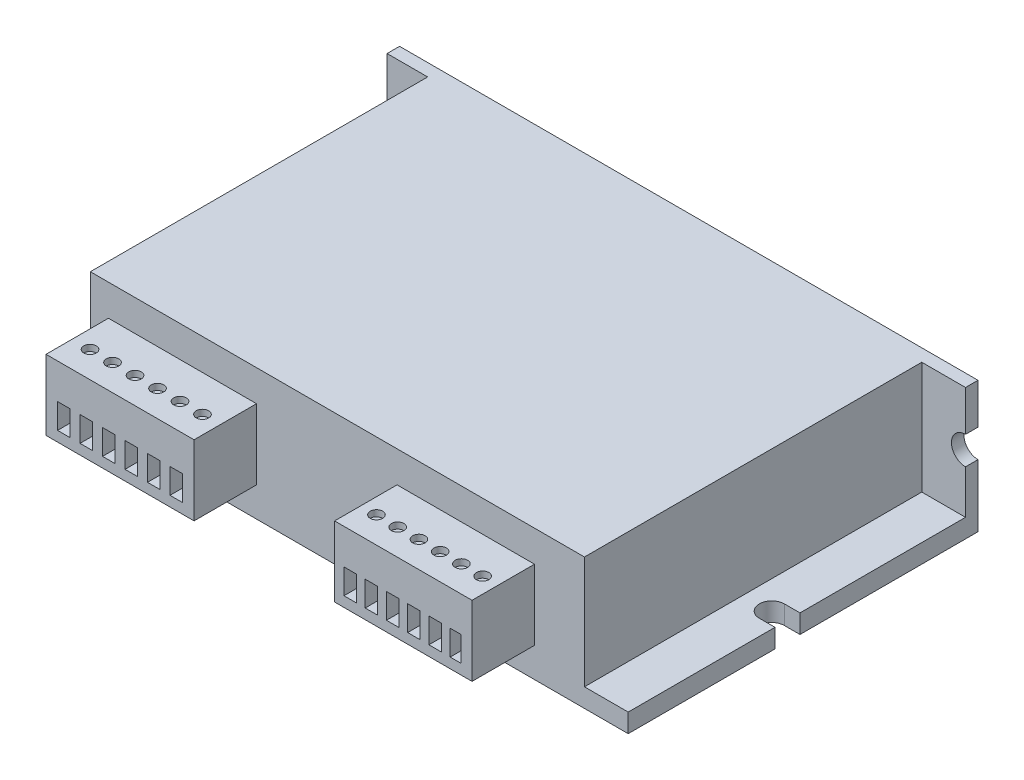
ISO-10303-21;
HEADER;
FILE_DESCRIPTION(('STEP AP214'),'2;1');
FILE_NAME('part.step','',(''),(''),'','','');
FILE_SCHEMA(('AUTOMOTIVE_DESIGN { 1 0 10303 214 1 1 1 1 }'));
ENDSEC;
DATA;
#1=APPLICATION_CONTEXT('core data for automotive mechanical design processes');
#2=APPLICATION_PROTOCOL_DEFINITION('international standard','automotive_design',2000,#1);
#3=PRODUCT_CONTEXT('',#1,'mechanical');
#4=PRODUCT('Part','Part','',(#3));
#5=PRODUCT_RELATED_PRODUCT_CATEGORY('part','',(#4));
#6=PRODUCT_DEFINITION_FORMATION('','',#4);
#7=PRODUCT_DEFINITION_CONTEXT('part definition',#1,'design');
#8=PRODUCT_DEFINITION('design','',#6,#7);
#9=PRODUCT_DEFINITION_SHAPE('','',#8);
#10=(LENGTH_UNIT() NAMED_UNIT(*) SI_UNIT(.MILLI.,.METRE.));
#11=(NAMED_UNIT(*) PLANE_ANGLE_UNIT() SI_UNIT($,.RADIAN.));
#12=(NAMED_UNIT(*) SI_UNIT($,.STERADIAN.) SOLID_ANGLE_UNIT());
#13=UNCERTAINTY_MEASURE_WITH_UNIT(LENGTH_MEASURE(1.E-05),#10,'distance_accuracy_value','');
#14=(GEOMETRIC_REPRESENTATION_CONTEXT(3) GLOBAL_UNCERTAINTY_ASSIGNED_CONTEXT((#13)) GLOBAL_UNIT_ASSIGNED_CONTEXT((#10,
#11,#12)) REPRESENTATION_CONTEXT('',''));
#15=CARTESIAN_POINT('',(0.,0.,0.));
#16=DIRECTION('',(0.,0.,1.));
#17=DIRECTION('',(1.,0.,0.));
#18=AXIS2_PLACEMENT_3D('',#15,#16,#17);
#19=CARTESIAN_POINT('',(0.,3.,0.));
#20=DIRECTION('',(0.,0.,-1.));
#21=DIRECTION('',(-1.,0.,0.));
#22=AXIS2_PLACEMENT_3D('',#19,#20,#21);
#23=PLANE('',#22);
#24=DIRECTION('',(0.,-1.,0.));
#25=VECTOR('',#24,1.);
#26=CARTESIAN_POINT('',(9.4,16.,0.));
#27=LINE('',#26,#25);
#28=CARTESIAN_POINT('',(9.4,16.,0.));
#29=VERTEX_POINT('',#28);
#30=CARTESIAN_POINT('',(9.4,4.75,0.));
#31=VERTEX_POINT('',#30);
#32=EDGE_CURVE('E1016',#29,#31,#27,.T.);
#33=ORIENTED_EDGE('',*,*,#32,.F.);
#34=DIRECTION('',(-1.,0.,0.));
#35=VECTOR('',#34,1.);
#36=CARTESIAN_POINT('',(9.4,16.,0.));
#37=LINE('',#36,#35);
#38=CARTESIAN_POINT('',(33.1,16.,0.));
#39=VERTEX_POINT('',#38);
#40=EDGE_CURVE('E1021',#39,#29,#37,.T.);
#41=ORIENTED_EDGE('',*,*,#40,.F.);
#42=DIRECTION('',(0.,1.,0.));
#43=VECTOR('',#42,1.);
#44=CARTESIAN_POINT('',(33.1,16.,0.));
#45=LINE('',#44,#43);
#46=CARTESIAN_POINT('',(33.1,4.75,0.));
#47=VERTEX_POINT('',#46);
#48=EDGE_CURVE('E1033',#47,#39,#45,.T.);
#49=ORIENTED_EDGE('',*,*,#48,.F.);
#50=DIRECTION('',(1.,0.,0.));
#51=VECTOR('',#50,1.);
#52=CARTESIAN_POINT('',(9.4,4.75,0.));
#53=LINE('',#52,#51);
#54=EDGE_CURVE('E1030',#31,#47,#53,.T.);
#55=ORIENTED_EDGE('',*,*,#54,.F.);
#56=EDGE_LOOP('',(#33,#41,#49,#55));
#57=FACE_BOUND('',#56,.T.);
#58=DIRECTION('',(1.,0.,0.));
#59=VECTOR('',#58,1.);
#60=CARTESIAN_POINT('',(0.,0.,0.));
#61=LINE('',#60,#59);
#62=CARTESIAN_POINT('',(0.,0.,0.));
#63=VERTEX_POINT('',#62);
#64=CARTESIAN_POINT('',(92.6,0.,0.));
#65=VERTEX_POINT('',#64);
#66=EDGE_CURVE('E1207',#63,#65,#61,.T.);
#67=ORIENTED_EDGE('',*,*,#66,.T.);
#68=DIRECTION('',(0.,-1.,0.));
#69=VECTOR('',#68,1.);
#70=CARTESIAN_POINT('',(92.6,3.,0.));
#71=LINE('',#70,#69);
#72=CARTESIAN_POINT('',(92.6,3.,0.));
#73=VERTEX_POINT('',#72);
#74=EDGE_CURVE('E45',#73,#65,#71,.T.);
#75=ORIENTED_EDGE('',*,*,#74,.F.);
#76=DIRECTION('',(1.,0.,0.));
#77=VECTOR('',#76,1.);
#78=CARTESIAN_POINT('',(0.,3.,0.));
#79=LINE('',#78,#77);
#80=CARTESIAN_POINT('',(85.6,3.,0.));
#81=VERTEX_POINT('',#80);
#82=EDGE_CURVE('E1191',#81,#73,#79,.T.);
#83=ORIENTED_EDGE('',*,*,#82,.F.);
#84=DIRECTION('',(0.,-1.,0.));
#85=VECTOR('',#84,1.);
#86=CARTESIAN_POINT('',(85.6,21.,0.));
#87=LINE('',#86,#85);
#88=CARTESIAN_POINT('',(85.6,21.,0.));
#89=VERTEX_POINT('',#88);
#90=EDGE_CURVE('E1139',#89,#81,#87,.T.);
#91=ORIENTED_EDGE('',*,*,#90,.F.);
#92=DIRECTION('',(1.,0.,0.));
#93=VECTOR('',#92,1.);
#94=CARTESIAN_POINT('',(6.50000000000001,21.,0.));
#95=LINE('',#94,#93);
#96=CARTESIAN_POINT('',(6.50000000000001,21.,0.));
#97=VERTEX_POINT('',#96);
#98=EDGE_CURVE('E1125',#97,#89,#95,.T.);
#99=ORIENTED_EDGE('',*,*,#98,.F.);
#100=DIRECTION('',(0.,-1.,0.));
#101=VECTOR('',#100,1.);
#102=CARTESIAN_POINT('',(6.50000000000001,21.,0.));
#103=LINE('',#102,#101);
#104=CARTESIAN_POINT('',(6.50000000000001,3.,0.));
#105=VERTEX_POINT('',#104);
#106=EDGE_CURVE('E1141',#97,#105,#103,.T.);
#107=ORIENTED_EDGE('',*,*,#106,.T.);
#108=CARTESIAN_POINT('',(0.,3.,0.));
#109=VERTEX_POINT('',#108);
#110=EDGE_CURVE('E1180',#109,#105,#79,.T.);
#111=ORIENTED_EDGE('',*,*,#110,.F.);
#112=DIRECTION('',(0.,-1.,0.));
#113=VECTOR('',#112,1.);
#114=CARTESIAN_POINT('',(0.,3.,0.));
#115=LINE('',#114,#113);
#116=EDGE_CURVE('E11',#109,#63,#115,.T.);
#117=ORIENTED_EDGE('',*,*,#116,.T.);
#118=EDGE_LOOP('',(#67,#75,#83,#91,#99,#107,#111,#117));
#119=FACE_BOUND('',#118,.T.);
#120=DIRECTION('',(0.,-1.,0.));
#121=VECTOR('',#120,1.);
#122=CARTESIAN_POINT('',(55.6,16.,0.));
#123=LINE('',#122,#121);
#124=CARTESIAN_POINT('',(55.6,16.,0.));
#125=VERTEX_POINT('',#124);
#126=CARTESIAN_POINT('',(55.6,4.75,0.));
#127=VERTEX_POINT('',#126);
#128=EDGE_CURVE('E981',#125,#127,#123,.T.);
#129=ORIENTED_EDGE('',*,*,#128,.F.);
#130=DIRECTION('',(-1.,0.,0.));
#131=VECTOR('',#130,1.);
#132=CARTESIAN_POINT('',(55.6,16.,0.));
#133=LINE('',#132,#131);
#134=CARTESIAN_POINT('',(77.6,16.,0.));
#135=VERTEX_POINT('',#134);
#136=EDGE_CURVE('E988',#135,#125,#133,.T.);
#137=ORIENTED_EDGE('',*,*,#136,.F.);
#138=DIRECTION('',(0.,1.,0.));
#139=VECTOR('',#138,1.);
#140=CARTESIAN_POINT('',(77.6,16.,0.));
#141=LINE('',#140,#139);
#142=CARTESIAN_POINT('',(77.6,4.75,0.));
#143=VERTEX_POINT('',#142);
#144=EDGE_CURVE('E1000',#143,#135,#141,.T.);
#145=ORIENTED_EDGE('',*,*,#144,.F.);
#146=DIRECTION('',(1.,0.,0.));
#147=VECTOR('',#146,1.);
#148=CARTESIAN_POINT('',(55.6,4.75,0.));
#149=LINE('',#148,#147);
#150=EDGE_CURVE('E997',#127,#143,#149,.T.);
#151=ORIENTED_EDGE('',*,*,#150,.F.);
#152=EDGE_LOOP('',(#129,#137,#145,#151));
#153=FACE_BOUND('',#152,.T.);
#154=ADVANCED_FACE('F35',(#57,#119,#153),#23,.F.);
#155=CARTESIAN_POINT('',(0.,3.,0.));
#156=DIRECTION('',(1.,0.,0.));
#157=DIRECTION('',(0.,0.,-1.));
#158=AXIS2_PLACEMENT_3D('',#155,#156,#157);
#159=PLANE('',#158);
#160=DIRECTION('',(0.,-1.,0.));
#161=VECTOR('',#160,1.);
#162=CARTESIAN_POINT('',(0.,21.,-54.));
#163=LINE('',#162,#161);
#164=CARTESIAN_POINT('',(0.,10.,-54.));
#165=VERTEX_POINT('',#164);
#166=CARTESIAN_POINT('',(0.,3.,-54.));
#167=VERTEX_POINT('',#166);
#168=EDGE_CURVE('E39',#165,#167,#163,.T.);
#169=ORIENTED_EDGE('',*,*,#168,.F.);
#170=DIRECTION('',(0.,0.,-1.));
#171=VECTOR('',#170,1.);
#172=CARTESIAN_POINT('',(0.,10.,-54.));
#173=LINE('',#172,#171);
#174=CARTESIAN_POINT('',(0.,10.,-56.));
#175=VERTEX_POINT('',#174);
#176=EDGE_CURVE('E1053',#165,#175,#173,.T.);
#177=ORIENTED_EDGE('',*,*,#176,.T.);
#178=DIRECTION('',(0.,-1.,0.));
#179=VECTOR('',#178,1.);
#180=CARTESIAN_POINT('',(0.,3.,-56.));
#181=LINE('',#180,#179);
#182=CARTESIAN_POINT('',(0.,0.,-56.));
#183=VERTEX_POINT('',#182);
#184=EDGE_CURVE('E1189',#175,#183,#181,.T.);
#185=ORIENTED_EDGE('',*,*,#184,.T.);
#186=DIRECTION('',(0.,0.,1.));
#187=VECTOR('',#186,1.);
#188=CARTESIAN_POINT('',(0.,0.,0.));
#189=LINE('',#188,#187);
#190=CARTESIAN_POINT('',(0.,0.,-27.5));
#191=VERTEX_POINT('',#190);
#192=EDGE_CURVE('E1184',#183,#191,#189,.T.);
#193=ORIENTED_EDGE('',*,*,#192,.T.);
#194=DIRECTION('',(0.,1.,0.));
#195=VECTOR('',#194,1.);
#196=CARTESIAN_POINT('',(0.,0.,-27.5));
#197=LINE('',#196,#195);
#198=CARTESIAN_POINT('',(0.,3.,-27.5));
#199=VERTEX_POINT('',#198);
#200=EDGE_CURVE('E1113',#191,#199,#197,.T.);
#201=ORIENTED_EDGE('',*,*,#200,.T.);
#202=DIRECTION('',(0.,0.,1.));
#203=VECTOR('',#202,1.);
#204=CARTESIAN_POINT('',(0.,3.,0.));
#205=LINE('',#204,#203);
#206=EDGE_CURVE('E1174',#167,#199,#205,.T.);
#207=ORIENTED_EDGE('',*,*,#206,.F.);
#208=EDGE_LOOP('',(#169,#177,#185,#193,#201,#207));
#209=FACE_BOUND('',#208,.T.);
#210=ADVANCED_FACE('F1311',(#209),#159,.F.);
#211=CARTESIAN_POINT('',(92.6,3.,0.));
#212=DIRECTION('',(-1.,0.,0.));
#213=DIRECTION('',(0.,0.,1.));
#214=AXIS2_PLACEMENT_3D('',#211,#212,#213);
#215=PLANE('',#214);
#216=DIRECTION('',(0.,-1.,0.));
#217=VECTOR('',#216,1.);
#218=CARTESIAN_POINT('',(92.6,21.,-54.));
#219=LINE('',#218,#217);
#220=CARTESIAN_POINT('',(92.6,21.,-54.));
#221=VERTEX_POINT('',#220);
#222=CARTESIAN_POINT('',(92.6,14.5,-54.));
#223=VERTEX_POINT('',#222);
#224=EDGE_CURVE('E1224',#221,#223,#219,.T.);
#225=ORIENTED_EDGE('',*,*,#224,.T.);
#226=DIRECTION('',(0.,0.,-1.));
#227=VECTOR('',#226,1.);
#228=CARTESIAN_POINT('',(92.6,14.5,-54.));
#229=LINE('',#228,#227);
#230=CARTESIAN_POINT('',(92.6,14.5,-56.));
#231=VERTEX_POINT('',#230);
#232=EDGE_CURVE('E1063',#223,#231,#229,.T.);
#233=ORIENTED_EDGE('',*,*,#232,.T.);
#234=DIRECTION('',(0.,-1.,0.));
#235=VECTOR('',#234,1.);
#236=CARTESIAN_POINT('',(92.6,3.,-56.));
#237=LINE('',#236,#235);
#238=CARTESIAN_POINT('',(92.6,21.,-56.));
#239=VERTEX_POINT('',#238);
#240=EDGE_CURVE('E1195',#239,#231,#237,.T.);
#241=ORIENTED_EDGE('',*,*,#240,.F.);
#242=DIRECTION('',(0.,0.,-1.));
#243=VECTOR('',#242,1.);
#244=CARTESIAN_POINT('',(92.6,21.,-56.));
#245=LINE('',#244,#243);
#246=EDGE_CURVE('E1152',#221,#239,#245,.T.);
#247=ORIENTED_EDGE('',*,*,#246,.F.);
#248=EDGE_LOOP('',(#225,#233,#241,#247));
#249=FACE_BOUND('',#248,.T.);
#250=ADVANCED_FACE('F1281',(#249),#215,.F.);
#251=DIRECTION('',(0.,0.,-1.));
#252=VECTOR('',#251,1.);
#253=CARTESIAN_POINT('',(92.6,0.,0.));
#254=LINE('',#253,#252);
#255=CARTESIAN_POINT('',(92.6,0.,-23.5));
#256=VERTEX_POINT('',#255);
#257=EDGE_CURVE('E1204',#65,#256,#254,.T.);
#258=ORIENTED_EDGE('',*,*,#257,.T.);
#259=DIRECTION('',(0.,1.,0.));
#260=VECTOR('',#259,1.);
#261=CARTESIAN_POINT('',(92.6,0.,-23.5));
#262=LINE('',#261,#260);
#263=CARTESIAN_POINT('',(92.6,3.,-23.5));
#264=VERTEX_POINT('',#263);
#265=EDGE_CURVE('E1087',#256,#264,#262,.T.);
#266=ORIENTED_EDGE('',*,*,#265,.T.);
#267=DIRECTION('',(0.,0.,-1.));
#268=VECTOR('',#267,1.);
#269=CARTESIAN_POINT('',(92.6,3.,0.));
#270=LINE('',#269,#268);
#271=EDGE_CURVE('E1179',#73,#264,#270,.T.);
#272=ORIENTED_EDGE('',*,*,#271,.F.);
#273=ORIENTED_EDGE('',*,*,#74,.T.);
#274=EDGE_LOOP('',(#258,#266,#272,#273));
#275=FACE_BOUND('',#274,.T.);
#276=ADVANCED_FACE('F1260',(#275),#215,.F.);
#277=CARTESIAN_POINT('',(0.,21.,-56.));
#278=VERTEX_POINT('',#277);
#279=CARTESIAN_POINT('',(0.,14.5,-56.));
#280=VERTEX_POINT('',#279);
#281=EDGE_CURVE('E1199',#278,#280,#181,.T.);
#282=ORIENTED_EDGE('',*,*,#281,.T.);
#283=DIRECTION('',(0.,0.,-1.));
#284=VECTOR('',#283,1.);
#285=CARTESIAN_POINT('',(0.,14.5,-54.));
#286=LINE('',#285,#284);
#287=CARTESIAN_POINT('',(0.,14.5,-54.));
#288=VERTEX_POINT('',#287);
#289=EDGE_CURVE('E1055',#288,#280,#286,.T.);
#290=ORIENTED_EDGE('',*,*,#289,.F.);
#291=CARTESIAN_POINT('',(0.,21.,-54.));
#292=VERTEX_POINT('',#291);
#293=EDGE_CURVE('E1216',#292,#288,#163,.T.);
#294=ORIENTED_EDGE('',*,*,#293,.F.);
#295=DIRECTION('',(0.,0.,1.));
#296=VECTOR('',#295,1.);
#297=CARTESIAN_POINT('',(0.,21.,-56.));
#298=LINE('',#297,#296);
#299=EDGE_CURVE('E1144',#278,#292,#298,.T.);
#300=ORIENTED_EDGE('',*,*,#299,.F.);
#301=EDGE_LOOP('',(#282,#290,#294,#300));
#302=FACE_BOUND('',#301,.T.);
#303=ADVANCED_FACE('F1285',(#302),#159,.F.);
#304=CARTESIAN_POINT('',(0.,3.,0.));
#305=DIRECTION('',(0.,-1.,0.));
#306=DIRECTION('',(0.,0.,-1.));
#307=AXIS2_PLACEMENT_3D('',#304,#305,#306);
#308=PLANE('',#307);
#309=ORIENTED_EDGE('',*,*,#206,.T.);
#310=DIRECTION('',(-1.,0.,0.));
#311=VECTOR('',#310,1.);
#312=CARTESIAN_POINT('',(0.,3.,-27.5));
#313=LINE('',#312,#311);
#314=CARTESIAN_POINT('',(2.5,3.,-27.5));
#315=VERTEX_POINT('',#314);
#316=EDGE_CURVE('E1100',#315,#199,#313,.T.);
#317=ORIENTED_EDGE('',*,*,#316,.F.);
#318=CARTESIAN_POINT('',(2.5,3.,-25.5));
#319=DIRECTION('',(0.,1.,0.));
#320=DIRECTION('',(0.,0.,-1.));
#321=AXIS2_PLACEMENT_3D('',#318,#319,#320);
#322=CIRCLE('',#321,2.);
#323=CARTESIAN_POINT('',(2.5,3.,-23.5));
#324=VERTEX_POINT('',#323);
#325=EDGE_CURVE('E1109',#324,#315,#322,.T.);
#326=ORIENTED_EDGE('',*,*,#325,.F.);
#327=DIRECTION('',(1.,0.,0.));
#328=VECTOR('',#327,1.);
#329=CARTESIAN_POINT('',(0.,3.,-23.5));
#330=LINE('',#329,#328);
#331=CARTESIAN_POINT('',(0.,3.,-23.5));
#332=VERTEX_POINT('',#331);
#333=EDGE_CURVE('E1090',#332,#324,#330,.T.);
#334=ORIENTED_EDGE('',*,*,#333,.F.);
#335=EDGE_CURVE('E1172',#332,#109,#205,.T.);
#336=ORIENTED_EDGE('',*,*,#335,.T.);
#337=ORIENTED_EDGE('',*,*,#110,.T.);
#338=DIRECTION('',(0.,0.,1.));
#339=VECTOR('',#338,1.);
#340=CARTESIAN_POINT('',(6.5,3.,-54.));
#341=LINE('',#340,#339);
#342=CARTESIAN_POINT('',(6.5,3.,-54.));
#343=VERTEX_POINT('',#342);
#344=EDGE_CURVE('E1116',#343,#105,#341,.T.);
#345=ORIENTED_EDGE('',*,*,#344,.F.);
#346=DIRECTION('',(1.,0.,0.));
#347=VECTOR('',#346,1.);
#348=CARTESIAN_POINT('',(0.,3.,-54.));
#349=LINE('',#348,#347);
#350=EDGE_CURVE('E1148',#167,#343,#349,.T.);
#351=ORIENTED_EDGE('',*,*,#350,.F.);
#352=EDGE_LOOP('',(#309,#317,#326,#334,#336,#337,#345,#351));
#353=FACE_BOUND('',#352,.T.);
#354=ADVANCED_FACE('F1295',(#353),#308,.F.);
#355=ORIENTED_EDGE('',*,*,#271,.T.);
#356=DIRECTION('',(1.,0.,0.));
#357=VECTOR('',#356,1.);
#358=CARTESIAN_POINT('',(92.6,3.,-23.5));
#359=LINE('',#358,#357);
#360=CARTESIAN_POINT('',(90.1,3.,-23.5));
#361=VERTEX_POINT('',#360);
#362=EDGE_CURVE('E1074',#361,#264,#359,.T.);
#363=ORIENTED_EDGE('',*,*,#362,.F.);
#364=CARTESIAN_POINT('',(90.1,3.,-25.5));
#365=DIRECTION('',(0.,1.,0.));
#366=DIRECTION('',(0.,0.,1.));
#367=AXIS2_PLACEMENT_3D('',#364,#365,#366);
#368=CIRCLE('',#367,2.);
#369=CARTESIAN_POINT('',(90.1,3.,-27.5));
#370=VERTEX_POINT('',#369);
#371=EDGE_CURVE('E1083',#370,#361,#368,.T.);
#372=ORIENTED_EDGE('',*,*,#371,.F.);
#373=DIRECTION('',(-1.,0.,0.));
#374=VECTOR('',#373,1.);
#375=CARTESIAN_POINT('',(92.6,3.,-27.5));
#376=LINE('',#375,#374);
#377=CARTESIAN_POINT('',(92.6,3.,-27.5));
#378=VERTEX_POINT('',#377);
#379=EDGE_CURVE('E1067',#378,#370,#376,.T.);
#380=ORIENTED_EDGE('',*,*,#379,.F.);
#381=CARTESIAN_POINT('',(92.6,3.,-54.));
#382=VERTEX_POINT('',#381);
#383=EDGE_CURVE('E1176',#378,#382,#270,.T.);
#384=ORIENTED_EDGE('',*,*,#383,.T.);
#385=CARTESIAN_POINT('',(85.6,3.,-54.));
#386=VERTEX_POINT('',#385);
#387=EDGE_CURVE('E1143',#386,#382,#349,.T.);
#388=ORIENTED_EDGE('',*,*,#387,.F.);
#389=DIRECTION('',(0.,0.,-1.));
#390=VECTOR('',#389,1.);
#391=CARTESIAN_POINT('',(85.6,3.,-54.));
#392=LINE('',#391,#390);
#393=EDGE_CURVE('E1126',#81,#386,#392,.T.);
#394=ORIENTED_EDGE('',*,*,#393,.F.);
#395=ORIENTED_EDGE('',*,*,#82,.T.);
#396=EDGE_LOOP('',(#355,#363,#372,#380,#384,#388,#394,#395));
#397=FACE_BOUND('',#396,.T.);
#398=ADVANCED_FACE('F1242',(#397),#308,.F.);
#399=CARTESIAN_POINT('',(0.,21.,-54.));
#400=DIRECTION('',(0.,0.,-1.));
#401=DIRECTION('',(-1.,0.,0.));
#402=AXIS2_PLACEMENT_3D('',#399,#400,#401);
#403=PLANE('',#402);
#404=ORIENTED_EDGE('',*,*,#293,.T.);
#405=CARTESIAN_POINT('',(0.,12.25,-54.));
#406=DIRECTION('',(0.,0.,-1.));
#407=DIRECTION('',(-1.,0.,0.));
#408=AXIS2_PLACEMENT_3D('',#405,#406,#407);
#409=CIRCLE('',#408,2.25);
#410=EDGE_CURVE('E1050',#288,#165,#409,.T.);
#411=ORIENTED_EDGE('',*,*,#410,.T.);
#412=ORIENTED_EDGE('',*,*,#168,.T.);
#413=ORIENTED_EDGE('',*,*,#350,.T.);
#414=DIRECTION('',(0.,-1.,0.));
#415=VECTOR('',#414,1.);
#416=CARTESIAN_POINT('',(6.5,21.,-54.));
#417=LINE('',#416,#415);
#418=CARTESIAN_POINT('',(6.5,21.,-54.));
#419=VERTEX_POINT('',#418);
#420=EDGE_CURVE('E1131',#419,#343,#417,.T.);
#421=ORIENTED_EDGE('',*,*,#420,.F.);
#422=DIRECTION('',(1.,0.,0.));
#423=VECTOR('',#422,1.);
#424=CARTESIAN_POINT('',(0.,21.,-54.));
#425=LINE('',#424,#423);
#426=EDGE_CURVE('E1149',#292,#419,#425,.T.);
#427=ORIENTED_EDGE('',*,*,#426,.F.);
#428=EDGE_LOOP('',(#404,#411,#412,#413,#421,#427));
#429=FACE_BOUND('',#428,.T.);
#430=ADVANCED_FACE('F1287',(#429),#403,.F.);
#431=CARTESIAN_POINT('',(92.6,10.,-54.));
#432=VERTEX_POINT('',#431);
#433=EDGE_CURVE('E1158',#432,#382,#219,.T.);
#434=ORIENTED_EDGE('',*,*,#433,.F.);
#435=CARTESIAN_POINT('',(92.6,12.25,-54.));
#436=DIRECTION('',(0.,0.,-1.));
#437=DIRECTION('',(-1.,0.,0.));
#438=AXIS2_PLACEMENT_3D('',#435,#436,#437);
#439=CIRCLE('',#438,2.25);
#440=EDGE_CURVE('E1060',#432,#223,#439,.T.);
#441=ORIENTED_EDGE('',*,*,#440,.T.);
#442=ORIENTED_EDGE('',*,*,#224,.F.);
#443=CARTESIAN_POINT('',(85.6,21.,-54.));
#444=VERTEX_POINT('',#443);
#445=EDGE_CURVE('E1147',#444,#221,#425,.T.);
#446=ORIENTED_EDGE('',*,*,#445,.F.);
#447=DIRECTION('',(0.,-1.,0.));
#448=VECTOR('',#447,1.);
#449=CARTESIAN_POINT('',(85.6,21.,-54.));
#450=LINE('',#449,#448);
#451=EDGE_CURVE('E1136',#444,#386,#450,.T.);
#452=ORIENTED_EDGE('',*,*,#451,.T.);
#453=ORIENTED_EDGE('',*,*,#387,.T.);
#454=EDGE_LOOP('',(#434,#441,#442,#446,#452,#453));
#455=FACE_BOUND('',#454,.T.);
#456=ADVANCED_FACE('F1245',(#455),#403,.F.);
#457=ORIENTED_EDGE('',*,*,#335,.F.);
#458=DIRECTION('',(0.,1.,0.));
#459=VECTOR('',#458,1.);
#460=CARTESIAN_POINT('',(0.,0.,-23.5));
#461=LINE('',#460,#459);
#462=CARTESIAN_POINT('',(0.,0.,-23.5));
#463=VERTEX_POINT('',#462);
#464=EDGE_CURVE('E1106',#463,#332,#461,.T.);
#465=ORIENTED_EDGE('',*,*,#464,.F.);
#466=EDGE_CURVE('E1213',#463,#63,#189,.T.);
#467=ORIENTED_EDGE('',*,*,#466,.T.);
#468=ORIENTED_EDGE('',*,*,#116,.F.);
#469=EDGE_LOOP('',(#457,#465,#467,#468));
#470=FACE_BOUND('',#469,.T.);
#471=ADVANCED_FACE('F37',(#470),#159,.F.);
#472=CARTESIAN_POINT('',(92.6,10.,-56.));
#473=VERTEX_POINT('',#472);
#474=CARTESIAN_POINT('',(92.6,0.,-56.));
#475=VERTEX_POINT('',#474);
#476=EDGE_CURVE('E1198',#473,#475,#237,.T.);
#477=ORIENTED_EDGE('',*,*,#476,.F.);
#478=DIRECTION('',(0.,0.,-1.));
#479=VECTOR('',#478,1.);
#480=CARTESIAN_POINT('',(92.6,10.,-54.));
#481=LINE('',#480,#479);
#482=EDGE_CURVE('E1065',#432,#473,#481,.T.);
#483=ORIENTED_EDGE('',*,*,#482,.F.);
#484=ORIENTED_EDGE('',*,*,#433,.T.);
#485=ORIENTED_EDGE('',*,*,#383,.F.);
#486=DIRECTION('',(0.,1.,0.));
#487=VECTOR('',#486,1.);
#488=CARTESIAN_POINT('',(92.6,0.,-27.5));
#489=LINE('',#488,#487);
#490=CARTESIAN_POINT('',(92.6,0.,-27.5));
#491=VERTEX_POINT('',#490);
#492=EDGE_CURVE('E1080',#491,#378,#489,.T.);
#493=ORIENTED_EDGE('',*,*,#492,.F.);
#494=EDGE_CURVE('E1206',#491,#475,#254,.T.);
#495=ORIENTED_EDGE('',*,*,#494,.T.);
#496=EDGE_LOOP('',(#477,#483,#484,#485,#493,#495));
#497=FACE_BOUND('',#496,.T.);
#498=ADVANCED_FACE('F1236',(#497),#215,.F.);
#499=CARTESIAN_POINT('',(0.,3.,-56.));
#500=DIRECTION('',(0.,0.,1.));
#501=DIRECTION('',(1.,0.,0.));
#502=AXIS2_PLACEMENT_3D('',#499,#500,#501);
#503=PLANE('',#502);
#504=ORIENTED_EDGE('',*,*,#184,.F.);
#505=CARTESIAN_POINT('',(0.,12.25,-56.));
#506=DIRECTION('',(0.,0.,-1.));
#507=DIRECTION('',(-1.,0.,0.));
#508=AXIS2_PLACEMENT_3D('',#505,#506,#507);
#509=CIRCLE('',#508,2.25);
#510=EDGE_CURVE('E1049',#280,#175,#509,.T.);
#511=ORIENTED_EDGE('',*,*,#510,.F.);
#512=ORIENTED_EDGE('',*,*,#281,.F.);
#513=DIRECTION('',(-1.,0.,0.));
#514=VECTOR('',#513,1.);
#515=CARTESIAN_POINT('',(0.,21.,-56.));
#516=LINE('',#515,#514);
#517=EDGE_CURVE('E1155',#239,#278,#516,.T.);
#518=ORIENTED_EDGE('',*,*,#517,.F.);
#519=ORIENTED_EDGE('',*,*,#240,.T.);
#520=CARTESIAN_POINT('',(92.6,12.25,-56.));
#521=DIRECTION('',(0.,0.,-1.));
#522=DIRECTION('',(-1.,0.,0.));
#523=AXIS2_PLACEMENT_3D('',#520,#521,#522);
#524=CIRCLE('',#523,2.25);
#525=EDGE_CURVE('E1057',#473,#231,#524,.T.);
#526=ORIENTED_EDGE('',*,*,#525,.F.);
#527=ORIENTED_EDGE('',*,*,#476,.T.);
#528=DIRECTION('',(-1.,0.,0.));
#529=VECTOR('',#528,1.);
#530=CARTESIAN_POINT('',(0.,0.,-56.));
#531=LINE('',#530,#529);
#532=EDGE_CURVE('E1175',#475,#183,#531,.T.);
#533=ORIENTED_EDGE('',*,*,#532,.T.);
#534=EDGE_LOOP('',(#504,#511,#512,#518,#519,#526,#527,#533));
#535=FACE_BOUND('',#534,.T.);
#536=ADVANCED_FACE('F1275',(#535),#503,.F.);
#537=CARTESIAN_POINT('',(0.,0.,0.));
#538=DIRECTION('',(0.,-1.,0.));
#539=DIRECTION('',(0.,0.,-1.));
#540=AXIS2_PLACEMENT_3D('',#537,#538,#539);
#541=PLANE('',#540);
#542=DIRECTION('',(1.,0.,0.));
#543=VECTOR('',#542,1.);
#544=CARTESIAN_POINT('',(92.6,0.,-23.5));
#545=LINE('',#544,#543);
#546=CARTESIAN_POINT('',(90.1,0.,-23.5));
#547=VERTEX_POINT('',#546);
#548=EDGE_CURVE('E1077',#547,#256,#545,.T.);
#549=ORIENTED_EDGE('',*,*,#548,.T.);
#550=ORIENTED_EDGE('',*,*,#257,.F.);
#551=ORIENTED_EDGE('',*,*,#66,.F.);
#552=ORIENTED_EDGE('',*,*,#466,.F.);
#553=DIRECTION('',(1.,0.,0.));
#554=VECTOR('',#553,1.);
#555=CARTESIAN_POINT('',(0.,0.,-23.5));
#556=LINE('',#555,#554);
#557=CARTESIAN_POINT('',(2.5,0.,-23.5));
#558=VERTEX_POINT('',#557);
#559=EDGE_CURVE('E1096',#463,#558,#556,.T.);
#560=ORIENTED_EDGE('',*,*,#559,.T.);
#561=CARTESIAN_POINT('',(2.5,0.,-25.5));
#562=DIRECTION('',(0.,1.,0.));
#563=DIRECTION('',(0.,0.,-1.));
#564=AXIS2_PLACEMENT_3D('',#561,#562,#563);
#565=CIRCLE('',#564,2.);
#566=CARTESIAN_POINT('',(2.5,0.,-27.5));
#567=VERTEX_POINT('',#566);
#568=EDGE_CURVE('E1099',#558,#567,#565,.T.);
#569=ORIENTED_EDGE('',*,*,#568,.T.);
#570=DIRECTION('',(-1.,0.,0.));
#571=VECTOR('',#570,1.);
#572=CARTESIAN_POINT('',(0.,0.,-27.5));
#573=LINE('',#572,#571);
#574=EDGE_CURVE('E1103',#567,#191,#573,.T.);
#575=ORIENTED_EDGE('',*,*,#574,.T.);
#576=ORIENTED_EDGE('',*,*,#192,.F.);
#577=ORIENTED_EDGE('',*,*,#532,.F.);
#578=ORIENTED_EDGE('',*,*,#494,.F.);
#579=DIRECTION('',(-1.,0.,0.));
#580=VECTOR('',#579,1.);
#581=CARTESIAN_POINT('',(92.6,0.,-27.5));
#582=LINE('',#581,#580);
#583=CARTESIAN_POINT('',(90.1,0.,-27.5));
#584=VERTEX_POINT('',#583);
#585=EDGE_CURVE('E1070',#491,#584,#582,.T.);
#586=ORIENTED_EDGE('',*,*,#585,.T.);
#587=CARTESIAN_POINT('',(90.1,0.,-25.5));
#588=DIRECTION('',(0.,1.,0.));
#589=DIRECTION('',(0.,0.,1.));
#590=AXIS2_PLACEMENT_3D('',#587,#588,#589);
#591=CIRCLE('',#590,2.);
#592=EDGE_CURVE('E1073',#584,#547,#591,.T.);
#593=ORIENTED_EDGE('',*,*,#592,.T.);
#594=EDGE_LOOP('',(#549,#550,#551,#552,#560,#569,#575,#576,#577,#578,#586,#593));
#595=FACE_BOUND('',#594,.T.);
#596=ADVANCED_FACE('F1265',(#595),#541,.T.);
#597=CARTESIAN_POINT('',(0.,21.,0.));
#598=DIRECTION('',(0.,1.,0.));
#599=DIRECTION('',(0.,0.,1.));
#600=AXIS2_PLACEMENT_3D('',#597,#598,#599);
#601=PLANE('',#600);
#602=ORIENTED_EDGE('',*,*,#299,.T.);
#603=ORIENTED_EDGE('',*,*,#426,.T.);
#604=DIRECTION('',(0.,0.,1.));
#605=VECTOR('',#604,1.);
#606=CARTESIAN_POINT('',(6.5,21.,-54.));
#607=LINE('',#606,#605);
#608=EDGE_CURVE('E1122',#419,#97,#607,.T.);
#609=ORIENTED_EDGE('',*,*,#608,.T.);
#610=ORIENTED_EDGE('',*,*,#98,.T.);
#611=DIRECTION('',(0.,0.,-1.));
#612=VECTOR('',#611,1.);
#613=CARTESIAN_POINT('',(85.6,21.,-54.));
#614=LINE('',#613,#612);
#615=EDGE_CURVE('E1128',#89,#444,#614,.T.);
#616=ORIENTED_EDGE('',*,*,#615,.T.);
#617=ORIENTED_EDGE('',*,*,#445,.T.);
#618=ORIENTED_EDGE('',*,*,#246,.T.);
#619=ORIENTED_EDGE('',*,*,#517,.T.);
#620=EDGE_LOOP('',(#602,#603,#609,#610,#616,#617,#618,#619));
#621=FACE_BOUND('',#620,.T.);
#622=ADVANCED_FACE('F1251',(#621),#601,.T.);
#623=CARTESIAN_POINT('',(6.5,21.,-54.));
#624=DIRECTION('',(1.,0.,0.));
#625=DIRECTION('',(0.,0.,-1.));
#626=AXIS2_PLACEMENT_3D('',#623,#624,#625);
#627=PLANE('',#626);
#628=ORIENTED_EDGE('',*,*,#344,.T.);
#629=ORIENTED_EDGE('',*,*,#106,.F.);
#630=ORIENTED_EDGE('',*,*,#608,.F.);
#631=ORIENTED_EDGE('',*,*,#420,.T.);
#632=EDGE_LOOP('',(#628,#629,#630,#631));
#633=FACE_BOUND('',#632,.T.);
#634=ADVANCED_FACE('F1292',(#633),#627,.F.);
#635=CARTESIAN_POINT('',(85.6,21.,-54.));
#636=DIRECTION('',(-1.,0.,0.));
#637=DIRECTION('',(0.,0.,1.));
#638=AXIS2_PLACEMENT_3D('',#635,#636,#637);
#639=PLANE('',#638);
#640=ORIENTED_EDGE('',*,*,#393,.T.);
#641=ORIENTED_EDGE('',*,*,#451,.F.);
#642=ORIENTED_EDGE('',*,*,#615,.F.);
#643=ORIENTED_EDGE('',*,*,#90,.T.);
#644=EDGE_LOOP('',(#640,#641,#642,#643));
#645=FACE_BOUND('',#644,.T.);
#646=ADVANCED_FACE('F1249',(#645),#639,.F.);
#647=CARTESIAN_POINT('',(0.,0.,-27.5));
#648=DIRECTION('',(0.,0.,-1.));
#649=DIRECTION('',(-1.,0.,0.));
#650=AXIS2_PLACEMENT_3D('',#647,#648,#649);
#651=PLANE('',#650);
#652=ORIENTED_EDGE('',*,*,#316,.T.);
#653=ORIENTED_EDGE('',*,*,#200,.F.);
#654=ORIENTED_EDGE('',*,*,#574,.F.);
#655=DIRECTION('',(0.,1.,0.));
#656=VECTOR('',#655,1.);
#657=CARTESIAN_POINT('',(2.5,0.,-27.5));
#658=LINE('',#657,#656);
#659=EDGE_CURVE('E1117',#567,#315,#658,.T.);
#660=ORIENTED_EDGE('',*,*,#659,.T.);
#661=EDGE_LOOP('',(#652,#653,#654,#660));
#662=FACE_BOUND('',#661,.T.);
#663=ADVANCED_FACE('F1309',(#662),#651,.F.);
#664=CARTESIAN_POINT('',(2.5,0.,-25.5));
#665=DIRECTION('',(0.,1.,0.));
#666=DIRECTION('',(0.,0.,1.));
#667=AXIS2_PLACEMENT_3D('',#664,#665,#666);
#668=CYLINDRICAL_SURFACE('',#667,2.);
#669=ORIENTED_EDGE('',*,*,#325,.T.);
#670=ORIENTED_EDGE('',*,*,#659,.F.);
#671=ORIENTED_EDGE('',*,*,#568,.F.);
#672=DIRECTION('',(0.,1.,0.));
#673=VECTOR('',#672,1.);
#674=CARTESIAN_POINT('',(2.5,0.,-23.5));
#675=LINE('',#674,#673);
#676=EDGE_CURVE('E1119',#558,#324,#675,.T.);
#677=ORIENTED_EDGE('',*,*,#676,.T.);
#678=EDGE_LOOP('',(#669,#670,#671,#677));
#679=FACE_BOUND('',#678,.T.);
#680=ADVANCED_FACE('F1305',(#679),#668,.F.);
#681=CARTESIAN_POINT('',(0.,0.,-23.5));
#682=DIRECTION('',(0.,0.,1.));
#683=DIRECTION('',(1.,0.,0.));
#684=AXIS2_PLACEMENT_3D('',#681,#682,#683);
#685=PLANE('',#684);
#686=ORIENTED_EDGE('',*,*,#333,.T.);
#687=ORIENTED_EDGE('',*,*,#676,.F.);
#688=ORIENTED_EDGE('',*,*,#559,.F.);
#689=ORIENTED_EDGE('',*,*,#464,.T.);
#690=EDGE_LOOP('',(#686,#687,#688,#689));
#691=FACE_BOUND('',#690,.T.);
#692=ADVANCED_FACE('F1302',(#691),#685,.F.);
#693=CARTESIAN_POINT('',(92.6,0.,-23.5));
#694=DIRECTION('',(0.,0.,1.));
#695=DIRECTION('',(1.,0.,0.));
#696=AXIS2_PLACEMENT_3D('',#693,#694,#695);
#697=PLANE('',#696);
#698=ORIENTED_EDGE('',*,*,#362,.T.);
#699=ORIENTED_EDGE('',*,*,#265,.F.);
#700=ORIENTED_EDGE('',*,*,#548,.F.);
#701=DIRECTION('',(0.,1.,0.));
#702=VECTOR('',#701,1.);
#703=CARTESIAN_POINT('',(90.1,0.,-23.5));
#704=LINE('',#703,#702);
#705=EDGE_CURVE('E1091',#547,#361,#704,.T.);
#706=ORIENTED_EDGE('',*,*,#705,.T.);
#707=EDGE_LOOP('',(#698,#699,#700,#706));
#708=FACE_BOUND('',#707,.T.);
#709=ADVANCED_FACE('F1263',(#708),#697,.F.);
#710=CARTESIAN_POINT('',(90.1,0.,-25.5));
#711=DIRECTION('',(0.,1.,0.));
#712=DIRECTION('',(0.,0.,1.));
#713=AXIS2_PLACEMENT_3D('',#710,#711,#712);
#714=CYLINDRICAL_SURFACE('',#713,2.);
#715=ORIENTED_EDGE('',*,*,#371,.T.);
#716=ORIENTED_EDGE('',*,*,#705,.F.);
#717=ORIENTED_EDGE('',*,*,#592,.F.);
#718=DIRECTION('',(0.,1.,0.));
#719=VECTOR('',#718,1.);
#720=CARTESIAN_POINT('',(90.1,0.,-27.5));
#721=LINE('',#720,#719);
#722=EDGE_CURVE('E1093',#584,#370,#721,.T.);
#723=ORIENTED_EDGE('',*,*,#722,.T.);
#724=EDGE_LOOP('',(#715,#716,#717,#723));
#725=FACE_BOUND('',#724,.T.);
#726=ADVANCED_FACE('F1269',(#725),#714,.F.);
#727=CARTESIAN_POINT('',(92.6,0.,-27.5));
#728=DIRECTION('',(0.,0.,-1.));
#729=DIRECTION('',(-1.,0.,0.));
#730=AXIS2_PLACEMENT_3D('',#727,#728,#729);
#731=PLANE('',#730);
#732=ORIENTED_EDGE('',*,*,#379,.T.);
#733=ORIENTED_EDGE('',*,*,#722,.F.);
#734=ORIENTED_EDGE('',*,*,#585,.F.);
#735=ORIENTED_EDGE('',*,*,#492,.T.);
#736=EDGE_LOOP('',(#732,#733,#734,#735));
#737=FACE_BOUND('',#736,.T.);
#738=ADVANCED_FACE('F1271',(#737),#731,.F.);
#739=CARTESIAN_POINT('',(92.6,12.25,-54.));
#740=DIRECTION('',(0.,0.,-1.));
#741=DIRECTION('',(-1.,0.,0.));
#742=AXIS2_PLACEMENT_3D('',#739,#740,#741);
#743=CYLINDRICAL_SURFACE('',#742,2.25);
#744=ORIENTED_EDGE('',*,*,#525,.T.);
#745=ORIENTED_EDGE('',*,*,#232,.F.);
#746=ORIENTED_EDGE('',*,*,#440,.F.);
#747=ORIENTED_EDGE('',*,*,#482,.T.);
#748=EDGE_LOOP('',(#744,#745,#746,#747));
#749=FACE_BOUND('',#748,.T.);
#750=ADVANCED_FACE('F1280',(#749),#743,.F.);
#751=CARTESIAN_POINT('',(0.,12.25,-54.));
#752=DIRECTION('',(0.,0.,-1.));
#753=DIRECTION('',(-1.,0.,0.));
#754=AXIS2_PLACEMENT_3D('',#751,#752,#753);
#755=CYLINDRICAL_SURFACE('',#754,2.25);
#756=ORIENTED_EDGE('',*,*,#510,.T.);
#757=ORIENTED_EDGE('',*,*,#176,.F.);
#758=ORIENTED_EDGE('',*,*,#410,.F.);
#759=ORIENTED_EDGE('',*,*,#289,.T.);
#760=EDGE_LOOP('',(#756,#757,#758,#759));
#761=FACE_BOUND('',#760,.T.);
#762=ADVANCED_FACE('F1313',(#761),#755,.F.);
#763=CARTESIAN_POINT('',(9.4,16.,10.));
#764=DIRECTION('',(1.,0.,0.));
#765=DIRECTION('',(0.,1.,0.));
#766=AXIS2_PLACEMENT_3D('',#763,#764,#765);
#767=PLANE('',#766);
#768=ORIENTED_EDGE('',*,*,#32,.T.);
#769=DIRECTION('',(0.,0.,-1.));
#770=VECTOR('',#769,1.);
#771=CARTESIAN_POINT('',(9.4,4.75,10.));
#772=LINE('',#771,#770);
#773=CARTESIAN_POINT('',(9.4,4.75,10.));
#774=VERTEX_POINT('',#773);
#775=EDGE_CURVE('E1046',#774,#31,#772,.T.);
#776=ORIENTED_EDGE('',*,*,#775,.F.);
#777=DIRECTION('',(0.,-1.,0.));
#778=VECTOR('',#777,1.);
#779=CARTESIAN_POINT('',(9.4,16.,10.));
#780=LINE('',#779,#778);
#781=CARTESIAN_POINT('',(9.4,16.,10.));
#782=VERTEX_POINT('',#781);
#783=EDGE_CURVE('E1017',#782,#774,#780,.T.);
#784=ORIENTED_EDGE('',*,*,#783,.F.);
#785=DIRECTION('',(0.,0.,-1.));
#786=VECTOR('',#785,1.);
#787=CARTESIAN_POINT('',(9.4,16.,10.));
#788=LINE('',#787,#786);
#789=EDGE_CURVE('E1027',#782,#29,#788,.T.);
#790=ORIENTED_EDGE('',*,*,#789,.T.);
#791=EDGE_LOOP('',(#768,#776,#784,#790));
#792=FACE_BOUND('',#791,.T.);
#793=ADVANCED_FACE('F1315',(#792),#767,.F.);
#794=CARTESIAN_POINT('',(9.4,4.75,10.));
#795=DIRECTION('',(0.,1.,0.));
#796=DIRECTION('',(0.,0.,1.));
#797=AXIS2_PLACEMENT_3D('',#794,#795,#796);
#798=PLANE('',#797);
#799=ORIENTED_EDGE('',*,*,#54,.T.);
#800=DIRECTION('',(0.,0.,-1.));
#801=VECTOR('',#800,1.);
#802=CARTESIAN_POINT('',(33.1,4.75,10.));
#803=LINE('',#802,#801);
#804=CARTESIAN_POINT('',(33.1,4.75,10.));
#805=VERTEX_POINT('',#804);
#806=EDGE_CURVE('E1043',#805,#47,#803,.T.);
#807=ORIENTED_EDGE('',*,*,#806,.F.);
#808=DIRECTION('',(1.,0.,0.));
#809=VECTOR('',#808,1.);
#810=CARTESIAN_POINT('',(9.4,4.75,10.));
#811=LINE('',#810,#809);
#812=EDGE_CURVE('E1020',#774,#805,#811,.T.);
#813=ORIENTED_EDGE('',*,*,#812,.F.);
#814=ORIENTED_EDGE('',*,*,#775,.T.);
#815=EDGE_LOOP('',(#799,#807,#813,#814));
#816=FACE_BOUND('',#815,.T.);
#817=ADVANCED_FACE('F1322',(#816),#798,.F.);
#818=CARTESIAN_POINT('',(33.1,16.,10.));
#819=DIRECTION('',(-1.,0.,0.));
#820=DIRECTION('',(0.,0.,1.));
#821=AXIS2_PLACEMENT_3D('',#818,#819,#820);
#822=PLANE('',#821);
#823=ORIENTED_EDGE('',*,*,#48,.T.);
#824=DIRECTION('',(0.,0.,-1.));
#825=VECTOR('',#824,1.);
#826=CARTESIAN_POINT('',(33.1,16.,10.));
#827=LINE('',#826,#825);
#828=CARTESIAN_POINT('',(33.1,16.,10.));
#829=VERTEX_POINT('',#828);
#830=EDGE_CURVE('E1040',#829,#39,#827,.T.);
#831=ORIENTED_EDGE('',*,*,#830,.F.);
#832=DIRECTION('',(0.,1.,0.));
#833=VECTOR('',#832,1.);
#834=CARTESIAN_POINT('',(33.1,16.,10.));
#835=LINE('',#834,#833);
#836=EDGE_CURVE('E1023',#805,#829,#835,.T.);
#837=ORIENTED_EDGE('',*,*,#836,.F.);
#838=ORIENTED_EDGE('',*,*,#806,.T.);
#839=EDGE_LOOP('',(#823,#831,#837,#838));
#840=FACE_BOUND('',#839,.T.);
#841=ADVANCED_FACE('F1406',(#840),#822,.F.);
#842=CARTESIAN_POINT('',(9.4,16.,10.));
#843=DIRECTION('',(0.,-1.,0.));
#844=DIRECTION('',(0.,0.,-1.));
#845=AXIS2_PLACEMENT_3D('',#842,#843,#844);
#846=PLANE('',#845);
#847=CARTESIAN_POINT('',(30.25,16.,5.8));
#848=DIRECTION('',(0.,1.,0.));
#849=DIRECTION('',(0.,0.,1.));
#850=AXIS2_PLACEMENT_3D('',#847,#848,#849);
#851=CIRCLE('',#850,1.);
#852=CARTESIAN_POINT('',(30.25,16.,6.8));
#853=VERTEX_POINT('',#852);
#854=EDGE_CURVE('E945',#853,#853,#851,.T.);
#855=ORIENTED_EDGE('',*,*,#854,.F.);
#856=EDGE_LOOP('',(#855));
#857=FACE_BOUND('',#856,.T.);
#858=CARTESIAN_POINT('',(26.65,16.,5.8));
#859=DIRECTION('',(0.,1.,0.));
#860=DIRECTION('',(0.,0.,1.));
#861=AXIS2_PLACEMENT_3D('',#858,#859,#860);
#862=CIRCLE('',#861,1.);
#863=CARTESIAN_POINT('',(26.65,16.,6.8));
#864=VERTEX_POINT('',#863);
#865=EDGE_CURVE('E951',#864,#864,#862,.T.);
#866=ORIENTED_EDGE('',*,*,#865,.F.);
#867=EDGE_LOOP('',(#866));
#868=FACE_BOUND('',#867,.T.);
#869=CARTESIAN_POINT('',(23.05,16.,5.8));
#870=DIRECTION('',(0.,1.,0.));
#871=DIRECTION('',(0.,0.,1.));
#872=AXIS2_PLACEMENT_3D('',#869,#870,#871);
#873=CIRCLE('',#872,1.);
#874=CARTESIAN_POINT('',(23.05,16.,6.8));
#875=VERTEX_POINT('',#874);
#876=EDGE_CURVE('E957',#875,#875,#873,.T.);
#877=ORIENTED_EDGE('',*,*,#876,.F.);
#878=EDGE_LOOP('',(#877));
#879=FACE_BOUND('',#878,.T.);
#880=CARTESIAN_POINT('',(19.45,16.,5.8));
#881=DIRECTION('',(0.,1.,0.));
#882=DIRECTION('',(0.,0.,1.));
#883=AXIS2_PLACEMENT_3D('',#880,#881,#882);
#884=CIRCLE('',#883,1.);
#885=CARTESIAN_POINT('',(19.45,16.,6.8));
#886=VERTEX_POINT('',#885);
#887=EDGE_CURVE('E963',#886,#886,#884,.T.);
#888=ORIENTED_EDGE('',*,*,#887,.F.);
#889=EDGE_LOOP('',(#888));
#890=FACE_BOUND('',#889,.T.);
#891=CARTESIAN_POINT('',(15.85,16.,5.8));
#892=DIRECTION('',(0.,1.,0.));
#893=DIRECTION('',(0.,0.,1.));
#894=AXIS2_PLACEMENT_3D('',#891,#892,#893);
#895=CIRCLE('',#894,1.);
#896=CARTESIAN_POINT('',(15.85,16.,6.8));
#897=VERTEX_POINT('',#896);
#898=EDGE_CURVE('E969',#897,#897,#895,.T.);
#899=ORIENTED_EDGE('',*,*,#898,.F.);
#900=EDGE_LOOP('',(#899));
#901=FACE_BOUND('',#900,.T.);
#902=CARTESIAN_POINT('',(12.25,16.,5.8));
#903=DIRECTION('',(0.,1.,0.));
#904=DIRECTION('',(0.,0.,1.));
#905=AXIS2_PLACEMENT_3D('',#902,#903,#904);
#906=CIRCLE('',#905,1.);
#907=CARTESIAN_POINT('',(12.25,16.,6.8));
#908=VERTEX_POINT('',#907);
#909=EDGE_CURVE('E975',#908,#908,#906,.T.);
#910=ORIENTED_EDGE('',*,*,#909,.F.);
#911=EDGE_LOOP('',(#910));
#912=FACE_BOUND('',#911,.T.);
#913=ORIENTED_EDGE('',*,*,#40,.T.);
#914=ORIENTED_EDGE('',*,*,#789,.F.);
#915=DIRECTION('',(-1.,0.,0.));
#916=VECTOR('',#915,1.);
#917=CARTESIAN_POINT('',(9.4,16.,10.));
#918=LINE('',#917,#916);
#919=EDGE_CURVE('E1025',#829,#782,#918,.T.);
#920=ORIENTED_EDGE('',*,*,#919,.F.);
#921=ORIENTED_EDGE('',*,*,#830,.T.);
#922=EDGE_LOOP('',(#913,#914,#920,#921));
#923=FACE_BOUND('',#922,.T.);
#924=ADVANCED_FACE('F1415',(#857,#868,#879,#890,#901,#912,#923),#846,.F.);
#925=CARTESIAN_POINT('',(0.,0.,10.));
#926=DIRECTION('',(0.,0.,1.));
#927=DIRECTION('',(1.,0.,0.));
#928=AXIS2_PLACEMENT_3D('',#925,#926,#927);
#929=PLANE('',#928);
#930=DIRECTION('',(0.,-1.,0.));
#931=VECTOR('',#930,1.);
#932=CARTESIAN_POINT('',(29.25,10.375,10.));
#933=LINE('',#932,#931);
#934=CARTESIAN_POINT('',(29.25,10.375,10.));
#935=VERTEX_POINT('',#934);
#936=CARTESIAN_POINT('',(29.25,6.375,10.));
#937=VERTEX_POINT('',#936);
#938=EDGE_CURVE('E681',#935,#937,#933,.T.);
#939=ORIENTED_EDGE('',*,*,#938,.F.);
#940=DIRECTION('',(-1.,0.,0.));
#941=VECTOR('',#940,1.);
#942=CARTESIAN_POINT('',(29.25,10.375,10.));
#943=LINE('',#942,#941);
#944=CARTESIAN_POINT('',(31.25,10.375,10.));
#945=VERTEX_POINT('',#944);
#946=EDGE_CURVE('E692',#945,#935,#943,.T.);
#947=ORIENTED_EDGE('',*,*,#946,.F.);
#948=DIRECTION('',(0.,1.,0.));
#949=VECTOR('',#948,1.);
#950=CARTESIAN_POINT('',(31.25,10.375,10.));
#951=LINE('',#950,#949);
#952=CARTESIAN_POINT('',(31.25,6.375,10.));
#953=VERTEX_POINT('',#952);
#954=EDGE_CURVE('E706',#953,#945,#951,.T.);
#955=ORIENTED_EDGE('',*,*,#954,.F.);
#956=DIRECTION('',(1.,0.,0.));
#957=VECTOR('',#956,1.);
#958=CARTESIAN_POINT('',(29.25,6.375,10.));
#959=LINE('',#958,#957);
#960=EDGE_CURVE('E703',#937,#953,#959,.T.);
#961=ORIENTED_EDGE('',*,*,#960,.F.);
#962=EDGE_LOOP('',(#939,#947,#955,#961));
#963=FACE_BOUND('',#962,.T.);
#964=DIRECTION('',(0.,-1.,0.));
#965=VECTOR('',#964,1.);
#966=CARTESIAN_POINT('',(25.65,10.375,10.));
#967=LINE('',#966,#965);
#968=CARTESIAN_POINT('',(25.65,10.375,10.));
#969=VERTEX_POINT('',#968);
#970=CARTESIAN_POINT('',(25.65,6.375,10.));
#971=VERTEX_POINT('',#970);
#972=EDGE_CURVE('E713',#969,#971,#967,.T.);
#973=ORIENTED_EDGE('',*,*,#972,.F.);
#974=DIRECTION('',(-1.,0.,0.));
#975=VECTOR('',#974,1.);
#976=CARTESIAN_POINT('',(25.65,10.375,10.));
#977=LINE('',#976,#975);
#978=CARTESIAN_POINT('',(27.65,10.375,10.));
#979=VERTEX_POINT('',#978);
#980=EDGE_CURVE('E724',#979,#969,#977,.T.);
#981=ORIENTED_EDGE('',*,*,#980,.F.);
#982=DIRECTION('',(0.,1.,0.));
#983=VECTOR('',#982,1.);
#984=CARTESIAN_POINT('',(27.65,10.375,10.));
#985=LINE('',#984,#983);
#986=CARTESIAN_POINT('',(27.65,6.375,10.));
#987=VERTEX_POINT('',#986);
#988=EDGE_CURVE('E738',#987,#979,#985,.T.);
#989=ORIENTED_EDGE('',*,*,#988,.F.);
#990=DIRECTION('',(1.,0.,0.));
#991=VECTOR('',#990,1.);
#992=CARTESIAN_POINT('',(25.65,6.375,10.));
#993=LINE('',#992,#991);
#994=EDGE_CURVE('E735',#971,#987,#993,.T.);
#995=ORIENTED_EDGE('',*,*,#994,.F.);
#996=EDGE_LOOP('',(#973,#981,#989,#995));
#997=FACE_BOUND('',#996,.T.);
#998=DIRECTION('',(0.,-1.,0.));
#999=VECTOR('',#998,1.);
#1000=CARTESIAN_POINT('',(18.45,10.375,10.));
#1001=LINE('',#1000,#999);
#1002=CARTESIAN_POINT('',(18.45,10.375,10.));
#1003=VERTEX_POINT('',#1002);
#1004=CARTESIAN_POINT('',(18.45,6.375,10.));
#1005=VERTEX_POINT('',#1004);
#1006=EDGE_CURVE('E745',#1003,#1005,#1001,.T.);
#1007=ORIENTED_EDGE('',*,*,#1006,.F.);
#1008=DIRECTION('',(-1.,0.,0.));
#1009=VECTOR('',#1008,1.);
#1010=CARTESIAN_POINT('',(18.45,10.375,10.));
#1011=LINE('',#1010,#1009);
#1012=CARTESIAN_POINT('',(20.45,10.375,10.));
#1013=VERTEX_POINT('',#1012);
#1014=EDGE_CURVE('E756',#1013,#1003,#1011,.T.);
#1015=ORIENTED_EDGE('',*,*,#1014,.F.);
#1016=DIRECTION('',(0.,1.,0.));
#1017=VECTOR('',#1016,1.);
#1018=CARTESIAN_POINT('',(20.45,10.375,10.));
#1019=LINE('',#1018,#1017);
#1020=CARTESIAN_POINT('',(20.45,6.375,10.));
#1021=VERTEX_POINT('',#1020);
#1022=EDGE_CURVE('E770',#1021,#1013,#1019,.T.);
#1023=ORIENTED_EDGE('',*,*,#1022,.F.);
#1024=DIRECTION('',(1.,0.,0.));
#1025=VECTOR('',#1024,1.);
#1026=CARTESIAN_POINT('',(18.45,6.375,10.));
#1027=LINE('',#1026,#1025);
#1028=EDGE_CURVE('E767',#1005,#1021,#1027,.T.);
#1029=ORIENTED_EDGE('',*,*,#1028,.F.);
#1030=EDGE_LOOP('',(#1007,#1015,#1023,#1029));
#1031=FACE_BOUND('',#1030,.T.);
#1032=DIRECTION('',(0.,-1.,0.));
#1033=VECTOR('',#1032,1.);
#1034=CARTESIAN_POINT('',(14.85,10.375,10.));
#1035=LINE('',#1034,#1033);
#1036=CARTESIAN_POINT('',(14.85,10.375,10.));
#1037=VERTEX_POINT('',#1036);
#1038=CARTESIAN_POINT('',(14.85,6.375,10.));
#1039=VERTEX_POINT('',#1038);
#1040=EDGE_CURVE('E777',#1037,#1039,#1035,.T.);
#1041=ORIENTED_EDGE('',*,*,#1040,.F.);
#1042=DIRECTION('',(-1.,0.,0.));
#1043=VECTOR('',#1042,1.);
#1044=CARTESIAN_POINT('',(14.85,10.375,10.));
#1045=LINE('',#1044,#1043);
#1046=CARTESIAN_POINT('',(16.85,10.375,10.));
#1047=VERTEX_POINT('',#1046);
#1048=EDGE_CURVE('E788',#1047,#1037,#1045,.T.);
#1049=ORIENTED_EDGE('',*,*,#1048,.F.);
#1050=DIRECTION('',(0.,1.,0.));
#1051=VECTOR('',#1050,1.);
#1052=CARTESIAN_POINT('',(16.85,10.375,10.));
#1053=LINE('',#1052,#1051);
#1054=CARTESIAN_POINT('',(16.85,6.375,10.));
#1055=VERTEX_POINT('',#1054);
#1056=EDGE_CURVE('E802',#1055,#1047,#1053,.T.);
#1057=ORIENTED_EDGE('',*,*,#1056,.F.);
#1058=DIRECTION('',(1.,0.,0.));
#1059=VECTOR('',#1058,1.);
#1060=CARTESIAN_POINT('',(14.85,6.375,10.));
#1061=LINE('',#1060,#1059);
#1062=EDGE_CURVE('E799',#1039,#1055,#1061,.T.);
#1063=ORIENTED_EDGE('',*,*,#1062,.F.);
#1064=EDGE_LOOP('',(#1041,#1049,#1057,#1063));
#1065=FACE_BOUND('',#1064,.T.);
#1066=DIRECTION('',(0.,-1.,0.));
#1067=VECTOR('',#1066,1.);
#1068=CARTESIAN_POINT('',(22.05,10.375,10.));
#1069=LINE('',#1068,#1067);
#1070=CARTESIAN_POINT('',(22.05,10.375,10.));
#1071=VERTEX_POINT('',#1070);
#1072=CARTESIAN_POINT('',(22.05,6.375,10.));
#1073=VERTEX_POINT('',#1072);
#1074=EDGE_CURVE('E809',#1071,#1073,#1069,.T.);
#1075=ORIENTED_EDGE('',*,*,#1074,.F.);
#1076=DIRECTION('',(-1.,0.,0.));
#1077=VECTOR('',#1076,1.);
#1078=CARTESIAN_POINT('',(22.05,10.375,10.));
#1079=LINE('',#1078,#1077);
#1080=CARTESIAN_POINT('',(24.05,10.375,10.));
#1081=VERTEX_POINT('',#1080);
#1082=EDGE_CURVE('E820',#1081,#1071,#1079,.T.);
#1083=ORIENTED_EDGE('',*,*,#1082,.F.);
#1084=DIRECTION('',(0.,1.,0.));
#1085=VECTOR('',#1084,1.);
#1086=CARTESIAN_POINT('',(24.05,10.375,10.));
#1087=LINE('',#1086,#1085);
#1088=CARTESIAN_POINT('',(24.05,6.375,10.));
#1089=VERTEX_POINT('',#1088);
#1090=EDGE_CURVE('E834',#1089,#1081,#1087,.T.);
#1091=ORIENTED_EDGE('',*,*,#1090,.F.);
#1092=DIRECTION('',(1.,0.,0.));
#1093=VECTOR('',#1092,1.);
#1094=CARTESIAN_POINT('',(22.05,6.375,10.));
#1095=LINE('',#1094,#1093);
#1096=EDGE_CURVE('E831',#1073,#1089,#1095,.T.);
#1097=ORIENTED_EDGE('',*,*,#1096,.F.);
#1098=EDGE_LOOP('',(#1075,#1083,#1091,#1097));
#1099=FACE_BOUND('',#1098,.T.);
#1100=DIRECTION('',(0.,-1.,0.));
#1101=VECTOR('',#1100,1.);
#1102=CARTESIAN_POINT('',(11.25,10.375,10.));
#1103=LINE('',#1102,#1101);
#1104=CARTESIAN_POINT('',(11.25,10.375,10.));
#1105=VERTEX_POINT('',#1104);
#1106=CARTESIAN_POINT('',(11.25,6.375,10.));
#1107=VERTEX_POINT('',#1106);
#1108=EDGE_CURVE('E873',#1105,#1107,#1103,.T.);
#1109=ORIENTED_EDGE('',*,*,#1108,.F.);
#1110=DIRECTION('',(-1.,0.,0.));
#1111=VECTOR('',#1110,1.);
#1112=CARTESIAN_POINT('',(11.25,10.375,10.));
#1113=LINE('',#1112,#1111);
#1114=CARTESIAN_POINT('',(13.25,10.375,10.));
#1115=VERTEX_POINT('',#1114);
#1116=EDGE_CURVE('E884',#1115,#1105,#1113,.T.);
#1117=ORIENTED_EDGE('',*,*,#1116,.F.);
#1118=DIRECTION('',(0.,1.,0.));
#1119=VECTOR('',#1118,1.);
#1120=CARTESIAN_POINT('',(13.25,10.375,10.));
#1121=LINE('',#1120,#1119);
#1122=CARTESIAN_POINT('',(13.25,6.375,10.));
#1123=VERTEX_POINT('',#1122);
#1124=EDGE_CURVE('E898',#1123,#1115,#1121,.T.);
#1125=ORIENTED_EDGE('',*,*,#1124,.F.);
#1126=DIRECTION('',(1.,0.,0.));
#1127=VECTOR('',#1126,1.);
#1128=CARTESIAN_POINT('',(11.25,6.375,10.));
#1129=LINE('',#1128,#1127);
#1130=EDGE_CURVE('E895',#1107,#1123,#1129,.T.);
#1131=ORIENTED_EDGE('',*,*,#1130,.F.);
#1132=EDGE_LOOP('',(#1109,#1117,#1125,#1131));
#1133=FACE_BOUND('',#1132,.T.);
#1134=ORIENTED_EDGE('',*,*,#783,.T.);
#1135=ORIENTED_EDGE('',*,*,#812,.T.);
#1136=ORIENTED_EDGE('',*,*,#836,.T.);
#1137=ORIENTED_EDGE('',*,*,#919,.T.);
#1138=EDGE_LOOP('',(#1134,#1135,#1136,#1137));
#1139=FACE_BOUND('',#1138,.T.);
#1140=ADVANCED_FACE('F1425',(#963,#997,#1031,#1065,#1099,#1133,#1139),#929,.T.);
#1141=CARTESIAN_POINT('',(55.6,16.,10.));
#1142=DIRECTION('',(1.,0.,0.));
#1143=DIRECTION('',(0.,0.,-1.));
#1144=AXIS2_PLACEMENT_3D('',#1141,#1142,#1143);
#1145=PLANE('',#1144);
#1146=ORIENTED_EDGE('',*,*,#128,.T.);
#1147=DIRECTION('',(0.,0.,-1.));
#1148=VECTOR('',#1147,1.);
#1149=CARTESIAN_POINT('',(55.6,4.75,10.));
#1150=LINE('',#1149,#1148);
#1151=CARTESIAN_POINT('',(55.6,4.75,10.));
#1152=VERTEX_POINT('',#1151);
#1153=EDGE_CURVE('E1013',#1152,#127,#1150,.T.);
#1154=ORIENTED_EDGE('',*,*,#1153,.F.);
#1155=DIRECTION('',(0.,-1.,0.));
#1156=VECTOR('',#1155,1.);
#1157=CARTESIAN_POINT('',(55.6,16.,10.));
#1158=LINE('',#1157,#1156);
#1159=CARTESIAN_POINT('',(55.6,16.,10.));
#1160=VERTEX_POINT('',#1159);
#1161=EDGE_CURVE('E984',#1160,#1152,#1158,.T.);
#1162=ORIENTED_EDGE('',*,*,#1161,.F.);
#1163=DIRECTION('',(0.,0.,-1.));
#1164=VECTOR('',#1163,1.);
#1165=CARTESIAN_POINT('',(55.6,16.,10.));
#1166=LINE('',#1165,#1164);
#1167=EDGE_CURVE('E994',#1160,#125,#1166,.T.);
#1168=ORIENTED_EDGE('',*,*,#1167,.T.);
#1169=EDGE_LOOP('',(#1146,#1154,#1162,#1168));
#1170=FACE_BOUND('',#1169,.T.);
#1171=ADVANCED_FACE('F1436',(#1170),#1145,.F.);
#1172=CARTESIAN_POINT('',(55.6,4.75,10.));
#1173=DIRECTION('',(0.,1.,0.));
#1174=DIRECTION('',(0.,0.,1.));
#1175=AXIS2_PLACEMENT_3D('',#1172,#1173,#1174);
#1176=PLANE('',#1175);
#1177=ORIENTED_EDGE('',*,*,#150,.T.);
#1178=DIRECTION('',(0.,0.,-1.));
#1179=VECTOR('',#1178,1.);
#1180=CARTESIAN_POINT('',(77.6,4.75,10.));
#1181=LINE('',#1180,#1179);
#1182=CARTESIAN_POINT('',(77.6,4.75,10.));
#1183=VERTEX_POINT('',#1182);
#1184=EDGE_CURVE('E1010',#1183,#143,#1181,.T.);
#1185=ORIENTED_EDGE('',*,*,#1184,.F.);
#1186=DIRECTION('',(1.,0.,0.));
#1187=VECTOR('',#1186,1.);
#1188=CARTESIAN_POINT('',(55.6,4.75,10.));
#1189=LINE('',#1188,#1187);
#1190=EDGE_CURVE('E987',#1152,#1183,#1189,.T.);
#1191=ORIENTED_EDGE('',*,*,#1190,.F.);
#1192=ORIENTED_EDGE('',*,*,#1153,.T.);
#1193=EDGE_LOOP('',(#1177,#1185,#1191,#1192));
#1194=FACE_BOUND('',#1193,.T.);
#1195=ADVANCED_FACE('F1446',(#1194),#1176,.F.);
#1196=CARTESIAN_POINT('',(77.6,16.,10.));
#1197=DIRECTION('',(-1.,0.,0.));
#1198=DIRECTION('',(0.,0.,1.));
#1199=AXIS2_PLACEMENT_3D('',#1196,#1197,#1198);
#1200=PLANE('',#1199);
#1201=ORIENTED_EDGE('',*,*,#144,.T.);
#1202=DIRECTION('',(0.,0.,-1.));
#1203=VECTOR('',#1202,1.);
#1204=CARTESIAN_POINT('',(77.6,16.,10.));
#1205=LINE('',#1204,#1203);
#1206=CARTESIAN_POINT('',(77.6,16.,10.));
#1207=VERTEX_POINT('',#1206);
#1208=EDGE_CURVE('E1007',#1207,#135,#1205,.T.);
#1209=ORIENTED_EDGE('',*,*,#1208,.F.);
#1210=DIRECTION('',(0.,1.,0.));
#1211=VECTOR('',#1210,1.);
#1212=CARTESIAN_POINT('',(77.6,16.,10.));
#1213=LINE('',#1212,#1211);
#1214=EDGE_CURVE('E990',#1183,#1207,#1213,.T.);
#1215=ORIENTED_EDGE('',*,*,#1214,.F.);
#1216=ORIENTED_EDGE('',*,*,#1184,.T.);
#1217=EDGE_LOOP('',(#1201,#1209,#1215,#1216));
#1218=FACE_BOUND('',#1217,.T.);
#1219=ADVANCED_FACE('F1455',(#1218),#1200,.F.);
#1220=CARTESIAN_POINT('',(55.6,16.,10.));
#1221=DIRECTION('',(0.,-1.,0.));
#1222=DIRECTION('',(0.,0.,-1.));
#1223=AXIS2_PLACEMENT_3D('',#1220,#1221,#1222);
#1224=PLANE('',#1223);
#1225=CARTESIAN_POINT('',(75.1,16.,5.8));
#1226=DIRECTION('',(0.,1.,0.));
#1227=DIRECTION('',(0.,0.,1.));
#1228=AXIS2_PLACEMENT_3D('',#1225,#1226,#1227);
#1229=CIRCLE('',#1228,0.999999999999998);
#1230=CARTESIAN_POINT('',(75.1,16.,6.8));
#1231=VERTEX_POINT('',#1230);
#1232=EDGE_CURVE('E905',#1231,#1231,#1229,.T.);
#1233=ORIENTED_EDGE('',*,*,#1232,.F.);
#1234=EDGE_LOOP('',(#1233));
#1235=FACE_BOUND('',#1234,.T.);
#1236=CARTESIAN_POINT('',(71.7,16.,5.8));
#1237=DIRECTION('',(0.,1.,0.));
#1238=DIRECTION('',(0.,0.,1.));
#1239=AXIS2_PLACEMENT_3D('',#1236,#1237,#1238);
#1240=CIRCLE('',#1239,0.999999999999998);
#1241=CARTESIAN_POINT('',(71.7,16.,6.8));
#1242=VERTEX_POINT('',#1241);
#1243=EDGE_CURVE('E915',#1242,#1242,#1240,.T.);
#1244=ORIENTED_EDGE('',*,*,#1243,.F.);
#1245=EDGE_LOOP('',(#1244));
#1246=FACE_BOUND('',#1245,.T.);
#1247=CARTESIAN_POINT('',(68.3,16.,5.8));
#1248=DIRECTION('',(0.,1.,0.));
#1249=DIRECTION('',(0.,0.,1.));
#1250=AXIS2_PLACEMENT_3D('',#1247,#1248,#1249);
#1251=CIRCLE('',#1250,0.999999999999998);
#1252=CARTESIAN_POINT('',(68.3,16.,6.8));
#1253=VERTEX_POINT('',#1252);
#1254=EDGE_CURVE('E921',#1253,#1253,#1251,.T.);
#1255=ORIENTED_EDGE('',*,*,#1254,.F.);
#1256=EDGE_LOOP('',(#1255));
#1257=FACE_BOUND('',#1256,.T.);
#1258=CARTESIAN_POINT('',(64.9,16.,5.8));
#1259=DIRECTION('',(0.,1.,0.));
#1260=DIRECTION('',(0.,0.,1.));
#1261=AXIS2_PLACEMENT_3D('',#1258,#1259,#1260);
#1262=CIRCLE('',#1261,0.999999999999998);
#1263=CARTESIAN_POINT('',(64.9,16.,6.8));
#1264=VERTEX_POINT('',#1263);
#1265=EDGE_CURVE('E927',#1264,#1264,#1262,.T.);
#1266=ORIENTED_EDGE('',*,*,#1265,.F.);
#1267=EDGE_LOOP('',(#1266));
#1268=FACE_BOUND('',#1267,.T.);
#1269=CARTESIAN_POINT('',(61.5,16.,5.8));
#1270=DIRECTION('',(0.,1.,0.));
#1271=DIRECTION('',(0.,0.,1.));
#1272=AXIS2_PLACEMENT_3D('',#1269,#1270,#1271);
#1273=CIRCLE('',#1272,0.999999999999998);
#1274=CARTESIAN_POINT('',(61.5,16.,6.8));
#1275=VERTEX_POINT('',#1274);
#1276=EDGE_CURVE('E933',#1275,#1275,#1273,.T.);
#1277=ORIENTED_EDGE('',*,*,#1276,.F.);
#1278=EDGE_LOOP('',(#1277));
#1279=FACE_BOUND('',#1278,.T.);
#1280=CARTESIAN_POINT('',(58.1,16.,5.8));
#1281=DIRECTION('',(0.,1.,0.));
#1282=DIRECTION('',(0.,0.,1.));
#1283=AXIS2_PLACEMENT_3D('',#1280,#1281,#1282);
#1284=CIRCLE('',#1283,0.999999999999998);
#1285=CARTESIAN_POINT('',(58.1,16.,6.8));
#1286=VERTEX_POINT('',#1285);
#1287=EDGE_CURVE('E939',#1286,#1286,#1284,.T.);
#1288=ORIENTED_EDGE('',*,*,#1287,.F.);
#1289=EDGE_LOOP('',(#1288));
#1290=FACE_BOUND('',#1289,.T.);
#1291=ORIENTED_EDGE('',*,*,#136,.T.);
#1292=ORIENTED_EDGE('',*,*,#1167,.F.);
#1293=DIRECTION('',(-1.,0.,0.));
#1294=VECTOR('',#1293,1.);
#1295=CARTESIAN_POINT('',(55.6,16.,10.));
#1296=LINE('',#1295,#1294);
#1297=EDGE_CURVE('E992',#1207,#1160,#1296,.T.);
#1298=ORIENTED_EDGE('',*,*,#1297,.F.);
#1299=ORIENTED_EDGE('',*,*,#1208,.T.);
#1300=EDGE_LOOP('',(#1291,#1292,#1298,#1299));
#1301=FACE_BOUND('',#1300,.T.);
#1302=ADVANCED_FACE('F1463',(#1235,#1246,#1257,#1268,#1279,#1290,#1301),#1224,.F.);
#1303=CARTESIAN_POINT('',(0.,0.,10.));
#1304=DIRECTION('',(0.,0.,1.));
#1305=DIRECTION('',(1.,0.,0.));
#1306=AXIS2_PLACEMENT_3D('',#1303,#1304,#1305);
#1307=PLANE('',#1306);
#1308=DIRECTION('',(0.,-1.,0.));
#1309=VECTOR('',#1308,1.);
#1310=CARTESIAN_POINT('',(70.7,10.375,10.));
#1311=LINE('',#1310,#1309);
#1312=CARTESIAN_POINT('',(70.7,10.375,10.));
#1313=VERTEX_POINT('',#1312);
#1314=CARTESIAN_POINT('',(70.7,6.375,10.));
#1315=VERTEX_POINT('',#1314);
#1316=EDGE_CURVE('E53',#1313,#1315,#1311,.T.);
#1317=ORIENTED_EDGE('',*,*,#1316,.F.);
#1318=DIRECTION('',(-1.,0.,0.));
#1319=VECTOR('',#1318,1.);
#1320=CARTESIAN_POINT('',(70.7,10.375,10.));
#1321=LINE('',#1320,#1319);
#1322=CARTESIAN_POINT('',(72.7,10.375,10.));
#1323=VERTEX_POINT('',#1322);
#1324=EDGE_CURVE('E543',#1323,#1313,#1321,.T.);
#1325=ORIENTED_EDGE('',*,*,#1324,.F.);
#1326=DIRECTION('',(0.,1.,0.));
#1327=VECTOR('',#1326,1.);
#1328=CARTESIAN_POINT('',(72.7,10.375,10.));
#1329=LINE('',#1328,#1327);
#1330=CARTESIAN_POINT('',(72.7,6.375,10.));
#1331=VERTEX_POINT('',#1330);
#1332=EDGE_CURVE('E546',#1331,#1323,#1329,.T.);
#1333=ORIENTED_EDGE('',*,*,#1332,.F.);
#1334=DIRECTION('',(1.,0.,0.));
#1335=VECTOR('',#1334,1.);
#1336=CARTESIAN_POINT('',(70.7,6.375,10.));
#1337=LINE('',#1336,#1335);
#1338=EDGE_CURVE('E552',#1315,#1331,#1337,.T.);
#1339=ORIENTED_EDGE('',*,*,#1338,.F.);
#1340=EDGE_LOOP('',(#1317,#1325,#1333,#1339));
#1341=FACE_BOUND('',#1340,.T.);
#1342=DIRECTION('',(0.,-1.,0.));
#1343=VECTOR('',#1342,1.);
#1344=CARTESIAN_POINT('',(74.1,10.375,10.));
#1345=LINE('',#1344,#1343);
#1346=CARTESIAN_POINT('',(74.1,10.375,10.));
#1347=VERTEX_POINT('',#1346);
#1348=CARTESIAN_POINT('',(74.1,6.375,10.));
#1349=VERTEX_POINT('',#1348);
#1350=EDGE_CURVE('E61',#1347,#1349,#1345,.T.);
#1351=ORIENTED_EDGE('',*,*,#1350,.F.);
#1352=DIRECTION('',(-1.,0.,0.));
#1353=VECTOR('',#1352,1.);
#1354=CARTESIAN_POINT('',(74.1,10.375,10.));
#1355=LINE('',#1354,#1353);
#1356=CARTESIAN_POINT('',(75.87,10.375,10.));
#1357=VERTEX_POINT('',#1356);
#1358=EDGE_CURVE('E565',#1357,#1347,#1355,.T.);
#1359=ORIENTED_EDGE('',*,*,#1358,.F.);
#1360=DIRECTION('',(0.,1.,0.));
#1361=VECTOR('',#1360,1.);
#1362=CARTESIAN_POINT('',(75.87,10.375,10.));
#1363=LINE('',#1362,#1361);
#1364=CARTESIAN_POINT('',(75.87,6.375,10.));
#1365=VERTEX_POINT('',#1364);
#1366=EDGE_CURVE('E579',#1365,#1357,#1363,.T.);
#1367=ORIENTED_EDGE('',*,*,#1366,.F.);
#1368=DIRECTION('',(1.,0.,0.));
#1369=VECTOR('',#1368,1.);
#1370=CARTESIAN_POINT('',(74.1,6.375,10.));
#1371=LINE('',#1370,#1369);
#1372=EDGE_CURVE('E576',#1349,#1365,#1371,.T.);
#1373=ORIENTED_EDGE('',*,*,#1372,.F.);
#1374=EDGE_LOOP('',(#1351,#1359,#1367,#1373));
#1375=FACE_BOUND('',#1374,.T.);
#1376=DIRECTION('',(0.,-1.,0.));
#1377=VECTOR('',#1376,1.);
#1378=CARTESIAN_POINT('',(67.3,10.375,10.));
#1379=LINE('',#1378,#1377);
#1380=CARTESIAN_POINT('',(67.3,10.375,10.));
#1381=VERTEX_POINT('',#1380);
#1382=CARTESIAN_POINT('',(67.3,6.375,10.));
#1383=VERTEX_POINT('',#1382);
#1384=EDGE_CURVE('E586',#1381,#1383,#1379,.T.);
#1385=ORIENTED_EDGE('',*,*,#1384,.F.);
#1386=DIRECTION('',(-1.,0.,0.));
#1387=VECTOR('',#1386,1.);
#1388=CARTESIAN_POINT('',(67.3,10.375,10.));
#1389=LINE('',#1388,#1387);
#1390=CARTESIAN_POINT('',(69.3,10.375,10.));
#1391=VERTEX_POINT('',#1390);
#1392=EDGE_CURVE('E596',#1391,#1381,#1389,.T.);
#1393=ORIENTED_EDGE('',*,*,#1392,.F.);
#1394=DIRECTION('',(0.,1.,0.));
#1395=VECTOR('',#1394,1.);
#1396=CARTESIAN_POINT('',(69.3,10.375,10.));
#1397=LINE('',#1396,#1395);
#1398=CARTESIAN_POINT('',(69.3,6.375,10.));
#1399=VERTEX_POINT('',#1398);
#1400=EDGE_CURVE('E610',#1399,#1391,#1397,.T.);
#1401=ORIENTED_EDGE('',*,*,#1400,.F.);
#1402=DIRECTION('',(1.,0.,0.));
#1403=VECTOR('',#1402,1.);
#1404=CARTESIAN_POINT('',(67.3,6.375,10.));
#1405=LINE('',#1404,#1403);
#1406=EDGE_CURVE('E607',#1383,#1399,#1405,.T.);
#1407=ORIENTED_EDGE('',*,*,#1406,.F.);
#1408=EDGE_LOOP('',(#1385,#1393,#1401,#1407));
#1409=FACE_BOUND('',#1408,.T.);
#1410=DIRECTION('',(0.,-1.,0.));
#1411=VECTOR('',#1410,1.);
#1412=CARTESIAN_POINT('',(63.9,10.375,10.));
#1413=LINE('',#1412,#1411);
#1414=CARTESIAN_POINT('',(63.9,10.375,10.));
#1415=VERTEX_POINT('',#1414);
#1416=CARTESIAN_POINT('',(63.9,6.375,10.));
#1417=VERTEX_POINT('',#1416);
#1418=EDGE_CURVE('E617',#1415,#1417,#1413,.T.);
#1419=ORIENTED_EDGE('',*,*,#1418,.F.);
#1420=DIRECTION('',(-1.,0.,0.));
#1421=VECTOR('',#1420,1.);
#1422=CARTESIAN_POINT('',(63.9,10.375,10.));
#1423=LINE('',#1422,#1421);
#1424=CARTESIAN_POINT('',(65.9,10.375,10.));
#1425=VERTEX_POINT('',#1424);
#1426=EDGE_CURVE('E628',#1425,#1415,#1423,.T.);
#1427=ORIENTED_EDGE('',*,*,#1426,.F.);
#1428=DIRECTION('',(0.,1.,0.));
#1429=VECTOR('',#1428,1.);
#1430=CARTESIAN_POINT('',(65.9,10.375,10.));
#1431=LINE('',#1430,#1429);
#1432=CARTESIAN_POINT('',(65.9,6.375,10.));
#1433=VERTEX_POINT('',#1432);
#1434=EDGE_CURVE('E642',#1433,#1425,#1431,.T.);
#1435=ORIENTED_EDGE('',*,*,#1434,.F.);
#1436=DIRECTION('',(1.,0.,0.));
#1437=VECTOR('',#1436,1.);
#1438=CARTESIAN_POINT('',(63.9,6.375,10.));
#1439=LINE('',#1438,#1437);
#1440=EDGE_CURVE('E639',#1417,#1433,#1439,.T.);
#1441=ORIENTED_EDGE('',*,*,#1440,.F.);
#1442=EDGE_LOOP('',(#1419,#1427,#1435,#1441));
#1443=FACE_BOUND('',#1442,.T.);
#1444=DIRECTION('',(0.,-1.,0.));
#1445=VECTOR('',#1444,1.);
#1446=CARTESIAN_POINT('',(60.5,10.375,10.));
#1447=LINE('',#1446,#1445);
#1448=CARTESIAN_POINT('',(60.5,10.375,10.));
#1449=VERTEX_POINT('',#1448);
#1450=CARTESIAN_POINT('',(60.5,6.375,10.));
#1451=VERTEX_POINT('',#1450);
#1452=EDGE_CURVE('E649',#1449,#1451,#1447,.T.);
#1453=ORIENTED_EDGE('',*,*,#1452,.F.);
#1454=DIRECTION('',(-1.,0.,0.));
#1455=VECTOR('',#1454,1.);
#1456=CARTESIAN_POINT('',(60.5,10.375,10.));
#1457=LINE('',#1456,#1455);
#1458=CARTESIAN_POINT('',(62.5,10.375,10.));
#1459=VERTEX_POINT('',#1458);
#1460=EDGE_CURVE('E660',#1459,#1449,#1457,.T.);
#1461=ORIENTED_EDGE('',*,*,#1460,.F.);
#1462=DIRECTION('',(0.,1.,0.));
#1463=VECTOR('',#1462,1.);
#1464=CARTESIAN_POINT('',(62.5,10.375,10.));
#1465=LINE('',#1464,#1463);
#1466=CARTESIAN_POINT('',(62.5,6.375,10.));
#1467=VERTEX_POINT('',#1466);
#1468=EDGE_CURVE('E674',#1467,#1459,#1465,.T.);
#1469=ORIENTED_EDGE('',*,*,#1468,.F.);
#1470=DIRECTION('',(1.,0.,0.));
#1471=VECTOR('',#1470,1.);
#1472=CARTESIAN_POINT('',(60.5,6.375,10.));
#1473=LINE('',#1472,#1471);
#1474=EDGE_CURVE('E671',#1451,#1467,#1473,.T.);
#1475=ORIENTED_EDGE('',*,*,#1474,.F.);
#1476=EDGE_LOOP('',(#1453,#1461,#1469,#1475));
#1477=FACE_BOUND('',#1476,.T.);
#1478=DIRECTION('',(0.,-1.,0.));
#1479=VECTOR('',#1478,1.);
#1480=CARTESIAN_POINT('',(57.1,10.375,10.));
#1481=LINE('',#1480,#1479);
#1482=CARTESIAN_POINT('',(57.1,10.375,10.));
#1483=VERTEX_POINT('',#1482);
#1484=CARTESIAN_POINT('',(57.1,6.375,10.));
#1485=VERTEX_POINT('',#1484);
#1486=EDGE_CURVE('E841',#1483,#1485,#1481,.T.);
#1487=ORIENTED_EDGE('',*,*,#1486,.F.);
#1488=DIRECTION('',(-1.,0.,0.));
#1489=VECTOR('',#1488,1.);
#1490=CARTESIAN_POINT('',(57.1,10.375,10.));
#1491=LINE('',#1490,#1489);
#1492=CARTESIAN_POINT('',(59.1,10.375,10.));
#1493=VERTEX_POINT('',#1492);
#1494=EDGE_CURVE('E852',#1493,#1483,#1491,.T.);
#1495=ORIENTED_EDGE('',*,*,#1494,.F.);
#1496=DIRECTION('',(0.,1.,0.));
#1497=VECTOR('',#1496,1.);
#1498=CARTESIAN_POINT('',(59.1,10.375,10.));
#1499=LINE('',#1498,#1497);
#1500=CARTESIAN_POINT('',(59.1,6.375,10.));
#1501=VERTEX_POINT('',#1500);
#1502=EDGE_CURVE('E866',#1501,#1493,#1499,.T.);
#1503=ORIENTED_EDGE('',*,*,#1502,.F.);
#1504=DIRECTION('',(1.,0.,0.));
#1505=VECTOR('',#1504,1.);
#1506=CARTESIAN_POINT('',(57.1,6.375,10.));
#1507=LINE('',#1506,#1505);
#1508=EDGE_CURVE('E863',#1485,#1501,#1507,.T.);
#1509=ORIENTED_EDGE('',*,*,#1508,.F.);
#1510=EDGE_LOOP('',(#1487,#1495,#1503,#1509));
#1511=FACE_BOUND('',#1510,.T.);
#1512=ORIENTED_EDGE('',*,*,#1161,.T.);
#1513=ORIENTED_EDGE('',*,*,#1190,.T.);
#1514=ORIENTED_EDGE('',*,*,#1214,.T.);
#1515=ORIENTED_EDGE('',*,*,#1297,.T.);
#1516=EDGE_LOOP('',(#1512,#1513,#1514,#1515));
#1517=FACE_BOUND('',#1516,.T.);
#1518=ADVANCED_FACE('F1471',(#1341,#1375,#1409,#1443,#1477,#1511,#1517),#1307,.T.);
#1519=CARTESIAN_POINT('',(12.25,15.,5.8));
#1520=DIRECTION('',(0.,1.,0.));
#1521=DIRECTION('',(0.,0.,1.));
#1522=AXIS2_PLACEMENT_3D('',#1519,#1520,#1521);
#1523=CYLINDRICAL_SURFACE('',#1522,1.);
#1524=CARTESIAN_POINT('',(12.25,15.,5.8));
#1525=DIRECTION('',(0.,1.,0.));
#1526=DIRECTION('',(0.,0.,1.));
#1527=AXIS2_PLACEMENT_3D('',#1524,#1525,#1526);
#1528=CIRCLE('',#1527,1.);
#1529=CARTESIAN_POINT('',(12.25,15.,6.8));
#1530=VERTEX_POINT('',#1529);
#1531=EDGE_CURVE('E978',#1530,#1530,#1528,.T.);
#1532=ORIENTED_EDGE('',*,*,#1531,.F.);
#1533=EDGE_LOOP('',(#1532));
#1534=FACE_BOUND('',#1533,.T.);
#1535=ORIENTED_EDGE('',*,*,#909,.T.);
#1536=EDGE_LOOP('',(#1535));
#1537=FACE_BOUND('',#1536,.T.);
#1538=ADVANCED_FACE('F1480',(#1534,#1537),#1523,.F.);
#1539=CARTESIAN_POINT('',(12.25,15.,5.8));
#1540=DIRECTION('',(0.,1.,0.));
#1541=DIRECTION('',(0.,0.,1.));
#1542=AXIS2_PLACEMENT_3D('',#1539,#1540,#1541);
#1543=PLANE('',#1542);
#1544=ORIENTED_EDGE('',*,*,#1531,.T.);
#1545=EDGE_LOOP('',(#1544));
#1546=FACE_BOUND('',#1545,.T.);
#1547=ADVANCED_FACE('F1489',(#1546),#1543,.T.);
#1548=CARTESIAN_POINT('',(15.85,15.,5.8));
#1549=DIRECTION('',(0.,1.,0.));
#1550=DIRECTION('',(0.,0.,1.));
#1551=AXIS2_PLACEMENT_3D('',#1548,#1549,#1550);
#1552=CYLINDRICAL_SURFACE('',#1551,1.);
#1553=CARTESIAN_POINT('',(15.85,15.,5.8));
#1554=DIRECTION('',(0.,1.,0.));
#1555=DIRECTION('',(0.,0.,1.));
#1556=AXIS2_PLACEMENT_3D('',#1553,#1554,#1555);
#1557=CIRCLE('',#1556,1.);
#1558=CARTESIAN_POINT('',(15.85,15.,6.8));
#1559=VERTEX_POINT('',#1558);
#1560=EDGE_CURVE('E972',#1559,#1559,#1557,.T.);
#1561=ORIENTED_EDGE('',*,*,#1560,.F.);
#1562=EDGE_LOOP('',(#1561));
#1563=FACE_BOUND('',#1562,.T.);
#1564=ORIENTED_EDGE('',*,*,#898,.T.);
#1565=EDGE_LOOP('',(#1564));
#1566=FACE_BOUND('',#1565,.T.);
#1567=ADVANCED_FACE('F1498',(#1563,#1566),#1552,.F.);
#1568=CARTESIAN_POINT('',(15.85,15.,5.8));
#1569=DIRECTION('',(0.,1.,0.));
#1570=DIRECTION('',(0.,0.,1.));
#1571=AXIS2_PLACEMENT_3D('',#1568,#1569,#1570);
#1572=PLANE('',#1571);
#1573=ORIENTED_EDGE('',*,*,#1560,.T.);
#1574=EDGE_LOOP('',(#1573));
#1575=FACE_BOUND('',#1574,.T.);
#1576=ADVANCED_FACE('F1507',(#1575),#1572,.T.);
#1577=CARTESIAN_POINT('',(19.45,15.,5.8));
#1578=DIRECTION('',(0.,1.,0.));
#1579=DIRECTION('',(0.,0.,1.));
#1580=AXIS2_PLACEMENT_3D('',#1577,#1578,#1579);
#1581=CYLINDRICAL_SURFACE('',#1580,1.);
#1582=CARTESIAN_POINT('',(19.45,15.,5.8));
#1583=DIRECTION('',(0.,1.,0.));
#1584=DIRECTION('',(0.,0.,1.));
#1585=AXIS2_PLACEMENT_3D('',#1582,#1583,#1584);
#1586=CIRCLE('',#1585,1.);
#1587=CARTESIAN_POINT('',(19.45,15.,6.8));
#1588=VERTEX_POINT('',#1587);
#1589=EDGE_CURVE('E966',#1588,#1588,#1586,.T.);
#1590=ORIENTED_EDGE('',*,*,#1589,.F.);
#1591=EDGE_LOOP('',(#1590));
#1592=FACE_BOUND('',#1591,.T.);
#1593=ORIENTED_EDGE('',*,*,#887,.T.);
#1594=EDGE_LOOP('',(#1593));
#1595=FACE_BOUND('',#1594,.T.);
#1596=ADVANCED_FACE('F1516',(#1592,#1595),#1581,.F.);
#1597=CARTESIAN_POINT('',(19.45,15.,5.8));
#1598=DIRECTION('',(0.,1.,0.));
#1599=DIRECTION('',(0.,0.,1.));
#1600=AXIS2_PLACEMENT_3D('',#1597,#1598,#1599);
#1601=PLANE('',#1600);
#1602=ORIENTED_EDGE('',*,*,#1589,.T.);
#1603=EDGE_LOOP('',(#1602));
#1604=FACE_BOUND('',#1603,.T.);
#1605=ADVANCED_FACE('F1525',(#1604),#1601,.T.);
#1606=CARTESIAN_POINT('',(23.05,15.,5.8));
#1607=DIRECTION('',(0.,1.,0.));
#1608=DIRECTION('',(0.,0.,1.));
#1609=AXIS2_PLACEMENT_3D('',#1606,#1607,#1608);
#1610=CYLINDRICAL_SURFACE('',#1609,1.);
#1611=CARTESIAN_POINT('',(23.05,15.,5.8));
#1612=DIRECTION('',(0.,1.,0.));
#1613=DIRECTION('',(0.,0.,1.));
#1614=AXIS2_PLACEMENT_3D('',#1611,#1612,#1613);
#1615=CIRCLE('',#1614,1.);
#1616=CARTESIAN_POINT('',(23.05,15.,6.8));
#1617=VERTEX_POINT('',#1616);
#1618=EDGE_CURVE('E960',#1617,#1617,#1615,.T.);
#1619=ORIENTED_EDGE('',*,*,#1618,.F.);
#1620=EDGE_LOOP('',(#1619));
#1621=FACE_BOUND('',#1620,.T.);
#1622=ORIENTED_EDGE('',*,*,#876,.T.);
#1623=EDGE_LOOP('',(#1622));
#1624=FACE_BOUND('',#1623,.T.);
#1625=ADVANCED_FACE('F1534',(#1621,#1624),#1610,.F.);
#1626=CARTESIAN_POINT('',(23.05,15.,5.8));
#1627=DIRECTION('',(0.,1.,0.));
#1628=DIRECTION('',(0.,0.,1.));
#1629=AXIS2_PLACEMENT_3D('',#1626,#1627,#1628);
#1630=PLANE('',#1629);
#1631=ORIENTED_EDGE('',*,*,#1618,.T.);
#1632=EDGE_LOOP('',(#1631));
#1633=FACE_BOUND('',#1632,.T.);
#1634=ADVANCED_FACE('F1543',(#1633),#1630,.T.);
#1635=CARTESIAN_POINT('',(26.65,15.,5.8));
#1636=DIRECTION('',(0.,1.,0.));
#1637=DIRECTION('',(0.,0.,1.));
#1638=AXIS2_PLACEMENT_3D('',#1635,#1636,#1637);
#1639=CYLINDRICAL_SURFACE('',#1638,1.);
#1640=CARTESIAN_POINT('',(26.65,15.,5.8));
#1641=DIRECTION('',(0.,1.,0.));
#1642=DIRECTION('',(0.,0.,1.));
#1643=AXIS2_PLACEMENT_3D('',#1640,#1641,#1642);
#1644=CIRCLE('',#1643,1.);
#1645=CARTESIAN_POINT('',(26.65,15.,6.8));
#1646=VERTEX_POINT('',#1645);
#1647=EDGE_CURVE('E954',#1646,#1646,#1644,.T.);
#1648=ORIENTED_EDGE('',*,*,#1647,.F.);
#1649=EDGE_LOOP('',(#1648));
#1650=FACE_BOUND('',#1649,.T.);
#1651=ORIENTED_EDGE('',*,*,#865,.T.);
#1652=EDGE_LOOP('',(#1651));
#1653=FACE_BOUND('',#1652,.T.);
#1654=ADVANCED_FACE('F1552',(#1650,#1653),#1639,.F.);
#1655=CARTESIAN_POINT('',(26.65,15.,5.8));
#1656=DIRECTION('',(0.,1.,0.));
#1657=DIRECTION('',(0.,0.,1.));
#1658=AXIS2_PLACEMENT_3D('',#1655,#1656,#1657);
#1659=PLANE('',#1658);
#1660=ORIENTED_EDGE('',*,*,#1647,.T.);
#1661=EDGE_LOOP('',(#1660));
#1662=FACE_BOUND('',#1661,.T.);
#1663=ADVANCED_FACE('F1561',(#1662),#1659,.T.);
#1664=CARTESIAN_POINT('',(30.25,15.,5.8));
#1665=DIRECTION('',(0.,1.,0.));
#1666=DIRECTION('',(0.,0.,1.));
#1667=AXIS2_PLACEMENT_3D('',#1664,#1665,#1666);
#1668=CYLINDRICAL_SURFACE('',#1667,1.);
#1669=CARTESIAN_POINT('',(30.25,15.,5.8));
#1670=DIRECTION('',(0.,1.,0.));
#1671=DIRECTION('',(0.,0.,1.));
#1672=AXIS2_PLACEMENT_3D('',#1669,#1670,#1671);
#1673=CIRCLE('',#1672,1.);
#1674=CARTESIAN_POINT('',(30.25,15.,6.8));
#1675=VERTEX_POINT('',#1674);
#1676=EDGE_CURVE('E948',#1675,#1675,#1673,.T.);
#1677=ORIENTED_EDGE('',*,*,#1676,.F.);
#1678=EDGE_LOOP('',(#1677));
#1679=FACE_BOUND('',#1678,.T.);
#1680=ORIENTED_EDGE('',*,*,#854,.T.);
#1681=EDGE_LOOP('',(#1680));
#1682=FACE_BOUND('',#1681,.T.);
#1683=ADVANCED_FACE('F1570',(#1679,#1682),#1668,.F.);
#1684=CARTESIAN_POINT('',(30.25,15.,5.8));
#1685=DIRECTION('',(0.,1.,0.));
#1686=DIRECTION('',(0.,0.,1.));
#1687=AXIS2_PLACEMENT_3D('',#1684,#1685,#1686);
#1688=PLANE('',#1687);
#1689=ORIENTED_EDGE('',*,*,#1676,.T.);
#1690=EDGE_LOOP('',(#1689));
#1691=FACE_BOUND('',#1690,.T.);
#1692=ADVANCED_FACE('F1579',(#1691),#1688,.T.);
#1693=CARTESIAN_POINT('',(58.1,15.,5.8));
#1694=DIRECTION('',(0.,1.,0.));
#1695=DIRECTION('',(0.,0.,1.));
#1696=AXIS2_PLACEMENT_3D('',#1693,#1694,#1695);
#1697=CYLINDRICAL_SURFACE('',#1696,0.999999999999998);
#1698=CARTESIAN_POINT('',(58.1,15.,5.8));
#1699=DIRECTION('',(0.,1.,0.));
#1700=DIRECTION('',(0.,0.,1.));
#1701=AXIS2_PLACEMENT_3D('',#1698,#1699,#1700);
#1702=CIRCLE('',#1701,0.999999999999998);
#1703=CARTESIAN_POINT('',(58.1,15.,6.8));
#1704=VERTEX_POINT('',#1703);
#1705=EDGE_CURVE('E942',#1704,#1704,#1702,.T.);
#1706=ORIENTED_EDGE('',*,*,#1705,.F.);
#1707=EDGE_LOOP('',(#1706));
#1708=FACE_BOUND('',#1707,.T.);
#1709=ORIENTED_EDGE('',*,*,#1287,.T.);
#1710=EDGE_LOOP('',(#1709));
#1711=FACE_BOUND('',#1710,.T.);
#1712=ADVANCED_FACE('F1588',(#1708,#1711),#1697,.F.);
#1713=CARTESIAN_POINT('',(58.1,15.,5.8));
#1714=DIRECTION('',(0.,1.,0.));
#1715=DIRECTION('',(0.,0.,1.));
#1716=AXIS2_PLACEMENT_3D('',#1713,#1714,#1715);
#1717=PLANE('',#1716);
#1718=ORIENTED_EDGE('',*,*,#1705,.T.);
#1719=EDGE_LOOP('',(#1718));
#1720=FACE_BOUND('',#1719,.T.);
#1721=ADVANCED_FACE('F1597',(#1720),#1717,.T.);
#1722=CARTESIAN_POINT('',(61.5,15.,5.8));
#1723=DIRECTION('',(0.,1.,0.));
#1724=DIRECTION('',(0.,0.,1.));
#1725=AXIS2_PLACEMENT_3D('',#1722,#1723,#1724);
#1726=CYLINDRICAL_SURFACE('',#1725,0.999999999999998);
#1727=CARTESIAN_POINT('',(61.5,15.,5.8));
#1728=DIRECTION('',(0.,1.,0.));
#1729=DIRECTION('',(0.,0.,1.));
#1730=AXIS2_PLACEMENT_3D('',#1727,#1728,#1729);
#1731=CIRCLE('',#1730,0.999999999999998);
#1732=CARTESIAN_POINT('',(61.5,15.,6.8));
#1733=VERTEX_POINT('',#1732);
#1734=EDGE_CURVE('E936',#1733,#1733,#1731,.T.);
#1735=ORIENTED_EDGE('',*,*,#1734,.F.);
#1736=EDGE_LOOP('',(#1735));
#1737=FACE_BOUND('',#1736,.T.);
#1738=ORIENTED_EDGE('',*,*,#1276,.T.);
#1739=EDGE_LOOP('',(#1738));
#1740=FACE_BOUND('',#1739,.T.);
#1741=ADVANCED_FACE('F1606',(#1737,#1740),#1726,.F.);
#1742=CARTESIAN_POINT('',(61.5,15.,5.8));
#1743=DIRECTION('',(0.,1.,0.));
#1744=DIRECTION('',(0.,0.,1.));
#1745=AXIS2_PLACEMENT_3D('',#1742,#1743,#1744);
#1746=PLANE('',#1745);
#1747=ORIENTED_EDGE('',*,*,#1734,.T.);
#1748=EDGE_LOOP('',(#1747));
#1749=FACE_BOUND('',#1748,.T.);
#1750=ADVANCED_FACE('F1615',(#1749),#1746,.T.);
#1751=CARTESIAN_POINT('',(64.9,15.,5.8));
#1752=DIRECTION('',(0.,1.,0.));
#1753=DIRECTION('',(0.,0.,1.));
#1754=AXIS2_PLACEMENT_3D('',#1751,#1752,#1753);
#1755=CYLINDRICAL_SURFACE('',#1754,0.999999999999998);
#1756=CARTESIAN_POINT('',(64.9,15.,5.8));
#1757=DIRECTION('',(0.,1.,0.));
#1758=DIRECTION('',(0.,0.,1.));
#1759=AXIS2_PLACEMENT_3D('',#1756,#1757,#1758);
#1760=CIRCLE('',#1759,0.999999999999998);
#1761=CARTESIAN_POINT('',(64.9,15.,6.8));
#1762=VERTEX_POINT('',#1761);
#1763=EDGE_CURVE('E930',#1762,#1762,#1760,.T.);
#1764=ORIENTED_EDGE('',*,*,#1763,.F.);
#1765=EDGE_LOOP('',(#1764));
#1766=FACE_BOUND('',#1765,.T.);
#1767=ORIENTED_EDGE('',*,*,#1265,.T.);
#1768=EDGE_LOOP('',(#1767));
#1769=FACE_BOUND('',#1768,.T.);
#1770=ADVANCED_FACE('F1624',(#1766,#1769),#1755,.F.);
#1771=CARTESIAN_POINT('',(64.9,15.,5.8));
#1772=DIRECTION('',(0.,1.,0.));
#1773=DIRECTION('',(0.,0.,1.));
#1774=AXIS2_PLACEMENT_3D('',#1771,#1772,#1773);
#1775=PLANE('',#1774);
#1776=ORIENTED_EDGE('',*,*,#1763,.T.);
#1777=EDGE_LOOP('',(#1776));
#1778=FACE_BOUND('',#1777,.T.);
#1779=ADVANCED_FACE('F1633',(#1778),#1775,.T.);
#1780=CARTESIAN_POINT('',(68.3,15.,5.8));
#1781=DIRECTION('',(0.,1.,0.));
#1782=DIRECTION('',(0.,0.,1.));
#1783=AXIS2_PLACEMENT_3D('',#1780,#1781,#1782);
#1784=CYLINDRICAL_SURFACE('',#1783,0.999999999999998);
#1785=CARTESIAN_POINT('',(68.3,15.,5.8));
#1786=DIRECTION('',(0.,1.,0.));
#1787=DIRECTION('',(0.,0.,1.));
#1788=AXIS2_PLACEMENT_3D('',#1785,#1786,#1787);
#1789=CIRCLE('',#1788,0.999999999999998);
#1790=CARTESIAN_POINT('',(68.3,15.,6.8));
#1791=VERTEX_POINT('',#1790);
#1792=EDGE_CURVE('E924',#1791,#1791,#1789,.T.);
#1793=ORIENTED_EDGE('',*,*,#1792,.F.);
#1794=EDGE_LOOP('',(#1793));
#1795=FACE_BOUND('',#1794,.T.);
#1796=ORIENTED_EDGE('',*,*,#1254,.T.);
#1797=EDGE_LOOP('',(#1796));
#1798=FACE_BOUND('',#1797,.T.);
#1799=ADVANCED_FACE('F1642',(#1795,#1798),#1784,.F.);
#1800=CARTESIAN_POINT('',(68.3,15.,5.8));
#1801=DIRECTION('',(0.,1.,0.));
#1802=DIRECTION('',(0.,0.,1.));
#1803=AXIS2_PLACEMENT_3D('',#1800,#1801,#1802);
#1804=PLANE('',#1803);
#1805=ORIENTED_EDGE('',*,*,#1792,.T.);
#1806=EDGE_LOOP('',(#1805));
#1807=FACE_BOUND('',#1806,.T.);
#1808=ADVANCED_FACE('F1651',(#1807),#1804,.T.);
#1809=CARTESIAN_POINT('',(71.7,15.,5.8));
#1810=DIRECTION('',(0.,1.,0.));
#1811=DIRECTION('',(0.,0.,1.));
#1812=AXIS2_PLACEMENT_3D('',#1809,#1810,#1811);
#1813=CYLINDRICAL_SURFACE('',#1812,0.999999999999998);
#1814=CARTESIAN_POINT('',(71.7,15.,5.8));
#1815=DIRECTION('',(0.,1.,0.));
#1816=DIRECTION('',(0.,0.,1.));
#1817=AXIS2_PLACEMENT_3D('',#1814,#1815,#1816);
#1818=CIRCLE('',#1817,0.999999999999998);
#1819=CARTESIAN_POINT('',(71.7,15.,6.8));
#1820=VERTEX_POINT('',#1819);
#1821=EDGE_CURVE('E918',#1820,#1820,#1818,.T.);
#1822=ORIENTED_EDGE('',*,*,#1821,.F.);
#1823=EDGE_LOOP('',(#1822));
#1824=FACE_BOUND('',#1823,.T.);
#1825=ORIENTED_EDGE('',*,*,#1243,.T.);
#1826=EDGE_LOOP('',(#1825));
#1827=FACE_BOUND('',#1826,.T.);
#1828=ADVANCED_FACE('F1660',(#1824,#1827),#1813,.F.);
#1829=CARTESIAN_POINT('',(71.7,15.,5.8));
#1830=DIRECTION('',(0.,1.,0.));
#1831=DIRECTION('',(0.,0.,1.));
#1832=AXIS2_PLACEMENT_3D('',#1829,#1830,#1831);
#1833=PLANE('',#1832);
#1834=ORIENTED_EDGE('',*,*,#1821,.T.);
#1835=EDGE_LOOP('',(#1834));
#1836=FACE_BOUND('',#1835,.T.);
#1837=ADVANCED_FACE('F1669',(#1836),#1833,.T.);
#1838=CARTESIAN_POINT('',(75.1,15.,5.8));
#1839=DIRECTION('',(0.,1.,0.));
#1840=DIRECTION('',(0.,0.,1.));
#1841=AXIS2_PLACEMENT_3D('',#1838,#1839,#1840);
#1842=CYLINDRICAL_SURFACE('',#1841,0.999999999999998);
#1843=CARTESIAN_POINT('',(75.1,15.,5.8));
#1844=DIRECTION('',(0.,1.,0.));
#1845=DIRECTION('',(0.,0.,1.));
#1846=AXIS2_PLACEMENT_3D('',#1843,#1844,#1845);
#1847=CIRCLE('',#1846,0.999999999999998);
#1848=CARTESIAN_POINT('',(75.1,15.,6.8));
#1849=VERTEX_POINT('',#1848);
#1850=EDGE_CURVE('E912',#1849,#1849,#1847,.T.);
#1851=ORIENTED_EDGE('',*,*,#1850,.F.);
#1852=EDGE_LOOP('',(#1851));
#1853=FACE_BOUND('',#1852,.T.);
#1854=ORIENTED_EDGE('',*,*,#1232,.T.);
#1855=EDGE_LOOP('',(#1854));
#1856=FACE_BOUND('',#1855,.T.);
#1857=ADVANCED_FACE('F1678',(#1853,#1856),#1842,.F.);
#1858=CARTESIAN_POINT('',(75.1,15.,5.8));
#1859=DIRECTION('',(0.,1.,0.));
#1860=DIRECTION('',(0.,0.,1.));
#1861=AXIS2_PLACEMENT_3D('',#1858,#1859,#1860);
#1862=PLANE('',#1861);
#1863=ORIENTED_EDGE('',*,*,#1850,.T.);
#1864=EDGE_LOOP('',(#1863));
#1865=FACE_BOUND('',#1864,.T.);
#1866=ADVANCED_FACE('F1687',(#1865),#1862,.T.);
#1867=CARTESIAN_POINT('',(11.25,10.375,7.));
#1868=DIRECTION('',(-1.,0.,0.));
#1869=DIRECTION('',(0.,0.,1.));
#1870=AXIS2_PLACEMENT_3D('',#1867,#1868,#1869);
#1871=PLANE('',#1870);
#1872=ORIENTED_EDGE('',*,*,#1108,.T.);
#1873=DIRECTION('',(0.,0.,1.));
#1874=VECTOR('',#1873,1.);
#1875=CARTESIAN_POINT('',(11.25,6.375,7.));
#1876=LINE('',#1875,#1874);
#1877=CARTESIAN_POINT('',(11.25,6.375,7.));
#1878=VERTEX_POINT('',#1877);
#1879=EDGE_CURVE('E893',#1878,#1107,#1876,.T.);
#1880=ORIENTED_EDGE('',*,*,#1879,.F.);
#1881=DIRECTION('',(0.,-1.,0.));
#1882=VECTOR('',#1881,1.);
#1883=CARTESIAN_POINT('',(11.25,10.375,7.));
#1884=LINE('',#1883,#1882);
#1885=CARTESIAN_POINT('',(11.25,10.375,7.));
#1886=VERTEX_POINT('',#1885);
#1887=EDGE_CURVE('E880',#1886,#1878,#1884,.T.);
#1888=ORIENTED_EDGE('',*,*,#1887,.F.);
#1889=DIRECTION('',(0.,0.,1.));
#1890=VECTOR('',#1889,1.);
#1891=CARTESIAN_POINT('',(11.25,10.375,7.));
#1892=LINE('',#1891,#1890);
#1893=EDGE_CURVE('E903',#1886,#1105,#1892,.T.);
#1894=ORIENTED_EDGE('',*,*,#1893,.T.);
#1895=EDGE_LOOP('',(#1872,#1880,#1888,#1894));
#1896=FACE_BOUND('',#1895,.T.);
#1897=ADVANCED_FACE('F1695',(#1896),#1871,.F.);
#1898=CARTESIAN_POINT('',(11.25,10.375,7.));
#1899=DIRECTION('',(0.,1.,0.));
#1900=DIRECTION('',(0.,0.,1.));
#1901=AXIS2_PLACEMENT_3D('',#1898,#1899,#1900);
#1902=PLANE('',#1901);
#1903=ORIENTED_EDGE('',*,*,#1116,.T.);
#1904=ORIENTED_EDGE('',*,*,#1893,.F.);
#1905=DIRECTION('',(-1.,0.,0.));
#1906=VECTOR('',#1905,1.);
#1907=CARTESIAN_POINT('',(11.25,10.375,7.));
#1908=LINE('',#1907,#1906);
#1909=CARTESIAN_POINT('',(13.25,10.375,7.));
#1910=VERTEX_POINT('',#1909);
#1911=EDGE_CURVE('E890',#1910,#1886,#1908,.T.);
#1912=ORIENTED_EDGE('',*,*,#1911,.F.);
#1913=DIRECTION('',(0.,0.,1.));
#1914=VECTOR('',#1913,1.);
#1915=CARTESIAN_POINT('',(13.25,10.375,7.));
#1916=LINE('',#1915,#1914);
#1917=EDGE_CURVE('E906',#1910,#1115,#1916,.T.);
#1918=ORIENTED_EDGE('',*,*,#1917,.T.);
#1919=EDGE_LOOP('',(#1903,#1904,#1912,#1918));
#1920=FACE_BOUND('',#1919,.T.);
#1921=ADVANCED_FACE('F1703',(#1920),#1902,.F.);
#1922=CARTESIAN_POINT('',(13.25,10.375,7.));
#1923=DIRECTION('',(1.,0.,0.));
#1924=DIRECTION('',(0.,0.,-1.));
#1925=AXIS2_PLACEMENT_3D('',#1922,#1923,#1924);
#1926=PLANE('',#1925);
#1927=ORIENTED_EDGE('',*,*,#1124,.T.);
#1928=ORIENTED_EDGE('',*,*,#1917,.F.);
#1929=DIRECTION('',(0.,1.,0.));
#1930=VECTOR('',#1929,1.);
#1931=CARTESIAN_POINT('',(13.25,10.375,7.));
#1932=LINE('',#1931,#1930);
#1933=CARTESIAN_POINT('',(13.25,6.375,7.));
#1934=VERTEX_POINT('',#1933);
#1935=EDGE_CURVE('E887',#1934,#1910,#1932,.T.);
#1936=ORIENTED_EDGE('',*,*,#1935,.F.);
#1937=DIRECTION('',(0.,0.,1.));
#1938=VECTOR('',#1937,1.);
#1939=CARTESIAN_POINT('',(13.25,6.375,7.));
#1940=LINE('',#1939,#1938);
#1941=EDGE_CURVE('E908',#1934,#1123,#1940,.T.);
#1942=ORIENTED_EDGE('',*,*,#1941,.T.);
#1943=EDGE_LOOP('',(#1927,#1928,#1936,#1942));
#1944=FACE_BOUND('',#1943,.T.);
#1945=ADVANCED_FACE('F1712',(#1944),#1926,.F.);
#1946=CARTESIAN_POINT('',(11.25,6.375,7.));
#1947=DIRECTION('',(0.,-1.,0.));
#1948=DIRECTION('',(0.,0.,-1.));
#1949=AXIS2_PLACEMENT_3D('',#1946,#1947,#1948);
#1950=PLANE('',#1949);
#1951=ORIENTED_EDGE('',*,*,#1130,.T.);
#1952=ORIENTED_EDGE('',*,*,#1941,.F.);
#1953=DIRECTION('',(1.,0.,0.));
#1954=VECTOR('',#1953,1.);
#1955=CARTESIAN_POINT('',(11.25,6.375,7.));
#1956=LINE('',#1955,#1954);
#1957=EDGE_CURVE('E883',#1878,#1934,#1956,.T.);
#1958=ORIENTED_EDGE('',*,*,#1957,.F.);
#1959=ORIENTED_EDGE('',*,*,#1879,.T.);
#1960=EDGE_LOOP('',(#1951,#1952,#1958,#1959));
#1961=FACE_BOUND('',#1960,.T.);
#1962=ADVANCED_FACE('F1721',(#1961),#1950,.F.);
#1963=CARTESIAN_POINT('',(0.,0.,7.));
#1964=DIRECTION('',(0.,0.,1.));
#1965=DIRECTION('',(1.,0.,0.));
#1966=AXIS2_PLACEMENT_3D('',#1963,#1964,#1965);
#1967=PLANE('',#1966);
#1968=ORIENTED_EDGE('',*,*,#1887,.T.);
#1969=ORIENTED_EDGE('',*,*,#1957,.T.);
#1970=ORIENTED_EDGE('',*,*,#1935,.T.);
#1971=ORIENTED_EDGE('',*,*,#1911,.T.);
#1972=EDGE_LOOP('',(#1968,#1969,#1970,#1971));
#1973=FACE_BOUND('',#1972,.T.);
#1974=ADVANCED_FACE('F1730',(#1973),#1967,.T.);
#1975=CARTESIAN_POINT('',(57.1,10.375,7.));
#1976=DIRECTION('',(-1.,0.,0.));
#1977=DIRECTION('',(0.,0.,1.));
#1978=AXIS2_PLACEMENT_3D('',#1975,#1976,#1977);
#1979=PLANE('',#1978);
#1980=ORIENTED_EDGE('',*,*,#1486,.T.);
#1981=DIRECTION('',(0.,0.,1.));
#1982=VECTOR('',#1981,1.);
#1983=CARTESIAN_POINT('',(57.1,6.375,7.));
#1984=LINE('',#1983,#1982);
#1985=CARTESIAN_POINT('',(57.1,6.375,7.));
#1986=VERTEX_POINT('',#1985);
#1987=EDGE_CURVE('E861',#1986,#1485,#1984,.T.);
#1988=ORIENTED_EDGE('',*,*,#1987,.F.);
#1989=DIRECTION('',(0.,-1.,0.));
#1990=VECTOR('',#1989,1.);
#1991=CARTESIAN_POINT('',(57.1,10.375,7.));
#1992=LINE('',#1991,#1990);
#1993=CARTESIAN_POINT('',(57.1,10.375,7.));
#1994=VERTEX_POINT('',#1993);
#1995=EDGE_CURVE('E848',#1994,#1986,#1992,.T.);
#1996=ORIENTED_EDGE('',*,*,#1995,.F.);
#1997=DIRECTION('',(0.,0.,1.));
#1998=VECTOR('',#1997,1.);
#1999=CARTESIAN_POINT('',(57.1,10.375,7.));
#2000=LINE('',#1999,#1998);
#2001=EDGE_CURVE('E871',#1994,#1483,#2000,.T.);
#2002=ORIENTED_EDGE('',*,*,#2001,.T.);
#2003=EDGE_LOOP('',(#1980,#1988,#1996,#2002));
#2004=FACE_BOUND('',#2003,.T.);
#2005=ADVANCED_FACE('F1739',(#2004),#1979,.F.);
#2006=CARTESIAN_POINT('',(57.1,10.375,7.));
#2007=DIRECTION('',(0.,1.,0.));
#2008=DIRECTION('',(0.,0.,1.));
#2009=AXIS2_PLACEMENT_3D('',#2006,#2007,#2008);
#2010=PLANE('',#2009);
#2011=ORIENTED_EDGE('',*,*,#1494,.T.);
#2012=ORIENTED_EDGE('',*,*,#2001,.F.);
#2013=DIRECTION('',(-1.,0.,0.));
#2014=VECTOR('',#2013,1.);
#2015=CARTESIAN_POINT('',(57.1,10.375,7.));
#2016=LINE('',#2015,#2014);
#2017=CARTESIAN_POINT('',(59.1,10.375,7.));
#2018=VERTEX_POINT('',#2017);
#2019=EDGE_CURVE('E858',#2018,#1994,#2016,.T.);
#2020=ORIENTED_EDGE('',*,*,#2019,.F.);
#2021=DIRECTION('',(0.,0.,1.));
#2022=VECTOR('',#2021,1.);
#2023=CARTESIAN_POINT('',(59.1,10.375,7.));
#2024=LINE('',#2023,#2022);
#2025=EDGE_CURVE('E874',#2018,#1493,#2024,.T.);
#2026=ORIENTED_EDGE('',*,*,#2025,.T.);
#2027=EDGE_LOOP('',(#2011,#2012,#2020,#2026));
#2028=FACE_BOUND('',#2027,.T.);
#2029=ADVANCED_FACE('F1748',(#2028),#2010,.F.);
#2030=CARTESIAN_POINT('',(59.1,10.375,7.));
#2031=DIRECTION('',(1.,0.,0.));
#2032=DIRECTION('',(0.,0.,-1.));
#2033=AXIS2_PLACEMENT_3D('',#2030,#2031,#2032);
#2034=PLANE('',#2033);
#2035=ORIENTED_EDGE('',*,*,#1502,.T.);
#2036=ORIENTED_EDGE('',*,*,#2025,.F.);
#2037=DIRECTION('',(0.,1.,0.));
#2038=VECTOR('',#2037,1.);
#2039=CARTESIAN_POINT('',(59.1,10.375,7.));
#2040=LINE('',#2039,#2038);
#2041=CARTESIAN_POINT('',(59.1,6.375,7.));
#2042=VERTEX_POINT('',#2041);
#2043=EDGE_CURVE('E855',#2042,#2018,#2040,.T.);
#2044=ORIENTED_EDGE('',*,*,#2043,.F.);
#2045=DIRECTION('',(0.,0.,1.));
#2046=VECTOR('',#2045,1.);
#2047=CARTESIAN_POINT('',(59.1,6.375,7.));
#2048=LINE('',#2047,#2046);
#2049=EDGE_CURVE('E876',#2042,#1501,#2048,.T.);
#2050=ORIENTED_EDGE('',*,*,#2049,.T.);
#2051=EDGE_LOOP('',(#2035,#2036,#2044,#2050));
#2052=FACE_BOUND('',#2051,.T.);
#2053=ADVANCED_FACE('F1757',(#2052),#2034,.F.);
#2054=CARTESIAN_POINT('',(57.1,6.375,7.));
#2055=DIRECTION('',(0.,-1.,0.));
#2056=DIRECTION('',(0.,0.,-1.));
#2057=AXIS2_PLACEMENT_3D('',#2054,#2055,#2056);
#2058=PLANE('',#2057);
#2059=ORIENTED_EDGE('',*,*,#1508,.T.);
#2060=ORIENTED_EDGE('',*,*,#2049,.F.);
#2061=DIRECTION('',(1.,0.,0.));
#2062=VECTOR('',#2061,1.);
#2063=CARTESIAN_POINT('',(57.1,6.375,7.));
#2064=LINE('',#2063,#2062);
#2065=EDGE_CURVE('E851',#1986,#2042,#2064,.T.);
#2066=ORIENTED_EDGE('',*,*,#2065,.F.);
#2067=ORIENTED_EDGE('',*,*,#1987,.T.);
#2068=EDGE_LOOP('',(#2059,#2060,#2066,#2067));
#2069=FACE_BOUND('',#2068,.T.);
#2070=ADVANCED_FACE('F1766',(#2069),#2058,.F.);
#2071=CARTESIAN_POINT('',(0.,0.,7.));
#2072=DIRECTION('',(0.,0.,1.));
#2073=DIRECTION('',(1.,0.,0.));
#2074=AXIS2_PLACEMENT_3D('',#2071,#2072,#2073);
#2075=PLANE('',#2074);
#2076=ORIENTED_EDGE('',*,*,#1995,.T.);
#2077=ORIENTED_EDGE('',*,*,#2065,.T.);
#2078=ORIENTED_EDGE('',*,*,#2043,.T.);
#2079=ORIENTED_EDGE('',*,*,#2019,.T.);
#2080=EDGE_LOOP('',(#2076,#2077,#2078,#2079));
#2081=FACE_BOUND('',#2080,.T.);
#2082=ADVANCED_FACE('F1775',(#2081),#2075,.T.);
#2083=CARTESIAN_POINT('',(22.05,10.375,7.));
#2084=DIRECTION('',(-1.,0.,0.));
#2085=DIRECTION('',(0.,-1.,0.));
#2086=AXIS2_PLACEMENT_3D('',#2083,#2084,#2085);
#2087=PLANE('',#2086);
#2088=ORIENTED_EDGE('',*,*,#1074,.T.);
#2089=DIRECTION('',(0.,0.,1.));
#2090=VECTOR('',#2089,1.);
#2091=CARTESIAN_POINT('',(22.05,6.375,7.));
#2092=LINE('',#2091,#2090);
#2093=CARTESIAN_POINT('',(22.05,6.375,7.));
#2094=VERTEX_POINT('',#2093);
#2095=EDGE_CURVE('E829',#2094,#1073,#2092,.T.);
#2096=ORIENTED_EDGE('',*,*,#2095,.F.);
#2097=DIRECTION('',(0.,-1.,0.));
#2098=VECTOR('',#2097,1.);
#2099=CARTESIAN_POINT('',(22.05,10.375,7.));
#2100=LINE('',#2099,#2098);
#2101=CARTESIAN_POINT('',(22.05,10.375,7.));
#2102=VERTEX_POINT('',#2101);
#2103=EDGE_CURVE('E816',#2102,#2094,#2100,.T.);
#2104=ORIENTED_EDGE('',*,*,#2103,.F.);
#2105=DIRECTION('',(0.,0.,1.));
#2106=VECTOR('',#2105,1.);
#2107=CARTESIAN_POINT('',(22.05,10.375,7.));
#2108=LINE('',#2107,#2106);
#2109=EDGE_CURVE('E839',#2102,#1071,#2108,.T.);
#2110=ORIENTED_EDGE('',*,*,#2109,.T.);
#2111=EDGE_LOOP('',(#2088,#2096,#2104,#2110));
#2112=FACE_BOUND('',#2111,.T.);
#2113=ADVANCED_FACE('F1784',(#2112),#2087,.F.);
#2114=CARTESIAN_POINT('',(22.05,10.375,7.));
#2115=DIRECTION('',(0.,1.,0.));
#2116=DIRECTION('',(0.,0.,1.));
#2117=AXIS2_PLACEMENT_3D('',#2114,#2115,#2116);
#2118=PLANE('',#2117);
#2119=ORIENTED_EDGE('',*,*,#1082,.T.);
#2120=ORIENTED_EDGE('',*,*,#2109,.F.);
#2121=DIRECTION('',(-1.,0.,0.));
#2122=VECTOR('',#2121,1.);
#2123=CARTESIAN_POINT('',(22.05,10.375,7.));
#2124=LINE('',#2123,#2122);
#2125=CARTESIAN_POINT('',(24.05,10.375,7.));
#2126=VERTEX_POINT('',#2125);
#2127=EDGE_CURVE('E826',#2126,#2102,#2124,.T.);
#2128=ORIENTED_EDGE('',*,*,#2127,.F.);
#2129=DIRECTION('',(0.,0.,1.));
#2130=VECTOR('',#2129,1.);
#2131=CARTESIAN_POINT('',(24.05,10.375,7.));
#2132=LINE('',#2131,#2130);
#2133=EDGE_CURVE('E842',#2126,#1081,#2132,.T.);
#2134=ORIENTED_EDGE('',*,*,#2133,.T.);
#2135=EDGE_LOOP('',(#2119,#2120,#2128,#2134));
#2136=FACE_BOUND('',#2135,.T.);
#2137=ADVANCED_FACE('F1793',(#2136),#2118,.F.);
#2138=CARTESIAN_POINT('',(24.05,10.375,7.));
#2139=DIRECTION('',(1.,0.,0.));
#2140=DIRECTION('',(0.,1.,0.));
#2141=AXIS2_PLACEMENT_3D('',#2138,#2139,#2140);
#2142=PLANE('',#2141);
#2143=ORIENTED_EDGE('',*,*,#1090,.T.);
#2144=ORIENTED_EDGE('',*,*,#2133,.F.);
#2145=DIRECTION('',(0.,1.,0.));
#2146=VECTOR('',#2145,1.);
#2147=CARTESIAN_POINT('',(24.05,10.375,7.));
#2148=LINE('',#2147,#2146);
#2149=CARTESIAN_POINT('',(24.05,6.375,7.));
#2150=VERTEX_POINT('',#2149);
#2151=EDGE_CURVE('E823',#2150,#2126,#2148,.T.);
#2152=ORIENTED_EDGE('',*,*,#2151,.F.);
#2153=DIRECTION('',(0.,0.,1.));
#2154=VECTOR('',#2153,1.);
#2155=CARTESIAN_POINT('',(24.05,6.375,7.));
#2156=LINE('',#2155,#2154);
#2157=EDGE_CURVE('E844',#2150,#1089,#2156,.T.);
#2158=ORIENTED_EDGE('',*,*,#2157,.T.);
#2159=EDGE_LOOP('',(#2143,#2144,#2152,#2158));
#2160=FACE_BOUND('',#2159,.T.);
#2161=ADVANCED_FACE('F1802',(#2160),#2142,.F.);
#2162=CARTESIAN_POINT('',(22.05,6.375,7.));
#2163=DIRECTION('',(0.,-1.,0.));
#2164=DIRECTION('',(0.,0.,-1.));
#2165=AXIS2_PLACEMENT_3D('',#2162,#2163,#2164);
#2166=PLANE('',#2165);
#2167=ORIENTED_EDGE('',*,*,#1096,.T.);
#2168=ORIENTED_EDGE('',*,*,#2157,.F.);
#2169=DIRECTION('',(1.,0.,0.));
#2170=VECTOR('',#2169,1.);
#2171=CARTESIAN_POINT('',(22.05,6.375,7.));
#2172=LINE('',#2171,#2170);
#2173=EDGE_CURVE('E819',#2094,#2150,#2172,.T.);
#2174=ORIENTED_EDGE('',*,*,#2173,.F.);
#2175=ORIENTED_EDGE('',*,*,#2095,.T.);
#2176=EDGE_LOOP('',(#2167,#2168,#2174,#2175));
#2177=FACE_BOUND('',#2176,.T.);
#2178=ADVANCED_FACE('F1811',(#2177),#2166,.F.);
#2179=CARTESIAN_POINT('',(0.,0.,7.));
#2180=DIRECTION('',(0.,0.,1.));
#2181=DIRECTION('',(1.,0.,0.));
#2182=AXIS2_PLACEMENT_3D('',#2179,#2180,#2181);
#2183=PLANE('',#2182);
#2184=ORIENTED_EDGE('',*,*,#2103,.T.);
#2185=ORIENTED_EDGE('',*,*,#2173,.T.);
#2186=ORIENTED_EDGE('',*,*,#2151,.T.);
#2187=ORIENTED_EDGE('',*,*,#2127,.T.);
#2188=EDGE_LOOP('',(#2184,#2185,#2186,#2187));
#2189=FACE_BOUND('',#2188,.T.);
#2190=ADVANCED_FACE('F1820',(#2189),#2183,.T.);
#2191=CARTESIAN_POINT('',(14.85,10.375,7.));
#2192=DIRECTION('',(-1.,0.,0.));
#2193=DIRECTION('',(0.,0.,1.));
#2194=AXIS2_PLACEMENT_3D('',#2191,#2192,#2193);
#2195=PLANE('',#2194);
#2196=ORIENTED_EDGE('',*,*,#1040,.T.);
#2197=DIRECTION('',(0.,0.,1.));
#2198=VECTOR('',#2197,1.);
#2199=CARTESIAN_POINT('',(14.85,6.375,7.));
#2200=LINE('',#2199,#2198);
#2201=CARTESIAN_POINT('',(14.85,6.375,7.));
#2202=VERTEX_POINT('',#2201);
#2203=EDGE_CURVE('E797',#2202,#1039,#2200,.T.);
#2204=ORIENTED_EDGE('',*,*,#2203,.F.);
#2205=DIRECTION('',(0.,-1.,0.));
#2206=VECTOR('',#2205,1.);
#2207=CARTESIAN_POINT('',(14.85,10.375,7.));
#2208=LINE('',#2207,#2206);
#2209=CARTESIAN_POINT('',(14.85,10.375,7.));
#2210=VERTEX_POINT('',#2209);
#2211=EDGE_CURVE('E784',#2210,#2202,#2208,.T.);
#2212=ORIENTED_EDGE('',*,*,#2211,.F.);
#2213=DIRECTION('',(0.,0.,1.));
#2214=VECTOR('',#2213,1.);
#2215=CARTESIAN_POINT('',(14.85,10.375,7.));
#2216=LINE('',#2215,#2214);
#2217=EDGE_CURVE('E807',#2210,#1037,#2216,.T.);
#2218=ORIENTED_EDGE('',*,*,#2217,.T.);
#2219=EDGE_LOOP('',(#2196,#2204,#2212,#2218));
#2220=FACE_BOUND('',#2219,.T.);
#2221=ADVANCED_FACE('F1829',(#2220),#2195,.F.);
#2222=CARTESIAN_POINT('',(14.85,10.375,7.));
#2223=DIRECTION('',(0.,1.,0.));
#2224=DIRECTION('',(0.,0.,1.));
#2225=AXIS2_PLACEMENT_3D('',#2222,#2223,#2224);
#2226=PLANE('',#2225);
#2227=ORIENTED_EDGE('',*,*,#1048,.T.);
#2228=ORIENTED_EDGE('',*,*,#2217,.F.);
#2229=DIRECTION('',(-1.,0.,0.));
#2230=VECTOR('',#2229,1.);
#2231=CARTESIAN_POINT('',(14.85,10.375,7.));
#2232=LINE('',#2231,#2230);
#2233=CARTESIAN_POINT('',(16.85,10.375,7.));
#2234=VERTEX_POINT('',#2233);
#2235=EDGE_CURVE('E794',#2234,#2210,#2232,.T.);
#2236=ORIENTED_EDGE('',*,*,#2235,.F.);
#2237=DIRECTION('',(0.,0.,1.));
#2238=VECTOR('',#2237,1.);
#2239=CARTESIAN_POINT('',(16.85,10.375,7.));
#2240=LINE('',#2239,#2238);
#2241=EDGE_CURVE('E810',#2234,#1047,#2240,.T.);
#2242=ORIENTED_EDGE('',*,*,#2241,.T.);
#2243=EDGE_LOOP('',(#2227,#2228,#2236,#2242));
#2244=FACE_BOUND('',#2243,.T.);
#2245=ADVANCED_FACE('F1838',(#2244),#2226,.F.);
#2246=CARTESIAN_POINT('',(16.85,10.375,7.));
#2247=DIRECTION('',(1.,0.,0.));
#2248=DIRECTION('',(0.,1.,0.));
#2249=AXIS2_PLACEMENT_3D('',#2246,#2247,#2248);
#2250=PLANE('',#2249);
#2251=ORIENTED_EDGE('',*,*,#1056,.T.);
#2252=ORIENTED_EDGE('',*,*,#2241,.F.);
#2253=DIRECTION('',(0.,1.,0.));
#2254=VECTOR('',#2253,1.);
#2255=CARTESIAN_POINT('',(16.85,10.375,7.));
#2256=LINE('',#2255,#2254);
#2257=CARTESIAN_POINT('',(16.85,6.375,7.));
#2258=VERTEX_POINT('',#2257);
#2259=EDGE_CURVE('E791',#2258,#2234,#2256,.T.);
#2260=ORIENTED_EDGE('',*,*,#2259,.F.);
#2261=DIRECTION('',(0.,0.,1.));
#2262=VECTOR('',#2261,1.);
#2263=CARTESIAN_POINT('',(16.85,6.375,7.));
#2264=LINE('',#2263,#2262);
#2265=EDGE_CURVE('E812',#2258,#1055,#2264,.T.);
#2266=ORIENTED_EDGE('',*,*,#2265,.T.);
#2267=EDGE_LOOP('',(#2251,#2252,#2260,#2266));
#2268=FACE_BOUND('',#2267,.T.);
#2269=ADVANCED_FACE('F1847',(#2268),#2250,.F.);
#2270=CARTESIAN_POINT('',(14.85,6.375,7.));
#2271=DIRECTION('',(0.,-1.,0.));
#2272=DIRECTION('',(0.,0.,-1.));
#2273=AXIS2_PLACEMENT_3D('',#2270,#2271,#2272);
#2274=PLANE('',#2273);
#2275=ORIENTED_EDGE('',*,*,#1062,.T.);
#2276=ORIENTED_EDGE('',*,*,#2265,.F.);
#2277=DIRECTION('',(1.,0.,0.));
#2278=VECTOR('',#2277,1.);
#2279=CARTESIAN_POINT('',(14.85,6.375,7.));
#2280=LINE('',#2279,#2278);
#2281=EDGE_CURVE('E787',#2202,#2258,#2280,.T.);
#2282=ORIENTED_EDGE('',*,*,#2281,.F.);
#2283=ORIENTED_EDGE('',*,*,#2203,.T.);
#2284=EDGE_LOOP('',(#2275,#2276,#2282,#2283));
#2285=FACE_BOUND('',#2284,.T.);
#2286=ADVANCED_FACE('F1856',(#2285),#2274,.F.);
#2287=CARTESIAN_POINT('',(0.,0.,7.));
#2288=DIRECTION('',(0.,0.,1.));
#2289=DIRECTION('',(1.,0.,0.));
#2290=AXIS2_PLACEMENT_3D('',#2287,#2288,#2289);
#2291=PLANE('',#2290);
#2292=ORIENTED_EDGE('',*,*,#2211,.T.);
#2293=ORIENTED_EDGE('',*,*,#2281,.T.);
#2294=ORIENTED_EDGE('',*,*,#2259,.T.);
#2295=ORIENTED_EDGE('',*,*,#2235,.T.);
#2296=EDGE_LOOP('',(#2292,#2293,#2294,#2295));
#2297=FACE_BOUND('',#2296,.T.);
#2298=ADVANCED_FACE('F1865',(#2297),#2291,.T.);
#2299=CARTESIAN_POINT('',(18.45,10.375,7.));
#2300=DIRECTION('',(-1.,0.,0.));
#2301=DIRECTION('',(0.,-1.,0.));
#2302=AXIS2_PLACEMENT_3D('',#2299,#2300,#2301);
#2303=PLANE('',#2302);
#2304=ORIENTED_EDGE('',*,*,#1006,.T.);
#2305=DIRECTION('',(0.,0.,1.));
#2306=VECTOR('',#2305,1.);
#2307=CARTESIAN_POINT('',(18.45,6.375,7.));
#2308=LINE('',#2307,#2306);
#2309=CARTESIAN_POINT('',(18.45,6.375,7.));
#2310=VERTEX_POINT('',#2309);
#2311=EDGE_CURVE('E765',#2310,#1005,#2308,.T.);
#2312=ORIENTED_EDGE('',*,*,#2311,.F.);
#2313=DIRECTION('',(0.,-1.,0.));
#2314=VECTOR('',#2313,1.);
#2315=CARTESIAN_POINT('',(18.45,10.375,7.));
#2316=LINE('',#2315,#2314);
#2317=CARTESIAN_POINT('',(18.45,10.375,7.));
#2318=VERTEX_POINT('',#2317);
#2319=EDGE_CURVE('E752',#2318,#2310,#2316,.T.);
#2320=ORIENTED_EDGE('',*,*,#2319,.F.);
#2321=DIRECTION('',(0.,0.,1.));
#2322=VECTOR('',#2321,1.);
#2323=CARTESIAN_POINT('',(18.45,10.375,7.));
#2324=LINE('',#2323,#2322);
#2325=EDGE_CURVE('E775',#2318,#1003,#2324,.T.);
#2326=ORIENTED_EDGE('',*,*,#2325,.T.);
#2327=EDGE_LOOP('',(#2304,#2312,#2320,#2326));
#2328=FACE_BOUND('',#2327,.T.);
#2329=ADVANCED_FACE('F1874',(#2328),#2303,.F.);
#2330=CARTESIAN_POINT('',(18.45,10.375,7.));
#2331=DIRECTION('',(0.,1.,0.));
#2332=DIRECTION('',(0.,0.,1.));
#2333=AXIS2_PLACEMENT_3D('',#2330,#2331,#2332);
#2334=PLANE('',#2333);
#2335=ORIENTED_EDGE('',*,*,#1014,.T.);
#2336=ORIENTED_EDGE('',*,*,#2325,.F.);
#2337=DIRECTION('',(-1.,0.,0.));
#2338=VECTOR('',#2337,1.);
#2339=CARTESIAN_POINT('',(18.45,10.375,7.));
#2340=LINE('',#2339,#2338);
#2341=CARTESIAN_POINT('',(20.45,10.375,7.));
#2342=VERTEX_POINT('',#2341);
#2343=EDGE_CURVE('E762',#2342,#2318,#2340,.T.);
#2344=ORIENTED_EDGE('',*,*,#2343,.F.);
#2345=DIRECTION('',(0.,0.,1.));
#2346=VECTOR('',#2345,1.);
#2347=CARTESIAN_POINT('',(20.45,10.375,7.));
#2348=LINE('',#2347,#2346);
#2349=EDGE_CURVE('E778',#2342,#1013,#2348,.T.);
#2350=ORIENTED_EDGE('',*,*,#2349,.T.);
#2351=EDGE_LOOP('',(#2335,#2336,#2344,#2350));
#2352=FACE_BOUND('',#2351,.T.);
#2353=ADVANCED_FACE('F1883',(#2352),#2334,.F.);
#2354=CARTESIAN_POINT('',(20.45,10.375,7.));
#2355=DIRECTION('',(1.,0.,0.));
#2356=DIRECTION('',(0.,1.,0.));
#2357=AXIS2_PLACEMENT_3D('',#2354,#2355,#2356);
#2358=PLANE('',#2357);
#2359=ORIENTED_EDGE('',*,*,#1022,.T.);
#2360=ORIENTED_EDGE('',*,*,#2349,.F.);
#2361=DIRECTION('',(0.,1.,0.));
#2362=VECTOR('',#2361,1.);
#2363=CARTESIAN_POINT('',(20.45,10.375,7.));
#2364=LINE('',#2363,#2362);
#2365=CARTESIAN_POINT('',(20.45,6.375,7.));
#2366=VERTEX_POINT('',#2365);
#2367=EDGE_CURVE('E759',#2366,#2342,#2364,.T.);
#2368=ORIENTED_EDGE('',*,*,#2367,.F.);
#2369=DIRECTION('',(0.,0.,1.));
#2370=VECTOR('',#2369,1.);
#2371=CARTESIAN_POINT('',(20.45,6.375,7.));
#2372=LINE('',#2371,#2370);
#2373=EDGE_CURVE('E780',#2366,#1021,#2372,.T.);
#2374=ORIENTED_EDGE('',*,*,#2373,.T.);
#2375=EDGE_LOOP('',(#2359,#2360,#2368,#2374));
#2376=FACE_BOUND('',#2375,.T.);
#2377=ADVANCED_FACE('F1892',(#2376),#2358,.F.);
#2378=CARTESIAN_POINT('',(18.45,6.375,7.));
#2379=DIRECTION('',(0.,-1.,0.));
#2380=DIRECTION('',(0.,0.,-1.));
#2381=AXIS2_PLACEMENT_3D('',#2378,#2379,#2380);
#2382=PLANE('',#2381);
#2383=ORIENTED_EDGE('',*,*,#1028,.T.);
#2384=ORIENTED_EDGE('',*,*,#2373,.F.);
#2385=DIRECTION('',(1.,0.,0.));
#2386=VECTOR('',#2385,1.);
#2387=CARTESIAN_POINT('',(18.45,6.375,7.));
#2388=LINE('',#2387,#2386);
#2389=EDGE_CURVE('E755',#2310,#2366,#2388,.T.);
#2390=ORIENTED_EDGE('',*,*,#2389,.F.);
#2391=ORIENTED_EDGE('',*,*,#2311,.T.);
#2392=EDGE_LOOP('',(#2383,#2384,#2390,#2391));
#2393=FACE_BOUND('',#2392,.T.);
#2394=ADVANCED_FACE('F1901',(#2393),#2382,.F.);
#2395=CARTESIAN_POINT('',(0.,0.,7.));
#2396=DIRECTION('',(0.,0.,1.));
#2397=DIRECTION('',(1.,0.,0.));
#2398=AXIS2_PLACEMENT_3D('',#2395,#2396,#2397);
#2399=PLANE('',#2398);
#2400=ORIENTED_EDGE('',*,*,#2319,.T.);
#2401=ORIENTED_EDGE('',*,*,#2389,.T.);
#2402=ORIENTED_EDGE('',*,*,#2367,.T.);
#2403=ORIENTED_EDGE('',*,*,#2343,.T.);
#2404=EDGE_LOOP('',(#2400,#2401,#2402,#2403));
#2405=FACE_BOUND('',#2404,.T.);
#2406=ADVANCED_FACE('F1910',(#2405),#2399,.T.);
#2407=CARTESIAN_POINT('',(25.65,10.375,7.));
#2408=DIRECTION('',(-1.,0.,0.));
#2409=DIRECTION('',(0.,-1.,0.));
#2410=AXIS2_PLACEMENT_3D('',#2407,#2408,#2409);
#2411=PLANE('',#2410);
#2412=ORIENTED_EDGE('',*,*,#972,.T.);
#2413=DIRECTION('',(0.,0.,1.));
#2414=VECTOR('',#2413,1.);
#2415=CARTESIAN_POINT('',(25.65,6.375,7.));
#2416=LINE('',#2415,#2414);
#2417=CARTESIAN_POINT('',(25.65,6.375,7.));
#2418=VERTEX_POINT('',#2417);
#2419=EDGE_CURVE('E733',#2418,#971,#2416,.T.);
#2420=ORIENTED_EDGE('',*,*,#2419,.F.);
#2421=DIRECTION('',(0.,-1.,0.));
#2422=VECTOR('',#2421,1.);
#2423=CARTESIAN_POINT('',(25.65,10.375,7.));
#2424=LINE('',#2423,#2422);
#2425=CARTESIAN_POINT('',(25.65,10.375,7.));
#2426=VERTEX_POINT('',#2425);
#2427=EDGE_CURVE('E720',#2426,#2418,#2424,.T.);
#2428=ORIENTED_EDGE('',*,*,#2427,.F.);
#2429=DIRECTION('',(0.,0.,1.));
#2430=VECTOR('',#2429,1.);
#2431=CARTESIAN_POINT('',(25.65,10.375,7.));
#2432=LINE('',#2431,#2430);
#2433=EDGE_CURVE('E743',#2426,#969,#2432,.T.);
#2434=ORIENTED_EDGE('',*,*,#2433,.T.);
#2435=EDGE_LOOP('',(#2412,#2420,#2428,#2434));
#2436=FACE_BOUND('',#2435,.T.);
#2437=ADVANCED_FACE('F1919',(#2436),#2411,.F.);
#2438=CARTESIAN_POINT('',(25.65,10.375,7.));
#2439=DIRECTION('',(0.,1.,0.));
#2440=DIRECTION('',(0.,0.,1.));
#2441=AXIS2_PLACEMENT_3D('',#2438,#2439,#2440);
#2442=PLANE('',#2441);
#2443=ORIENTED_EDGE('',*,*,#980,.T.);
#2444=ORIENTED_EDGE('',*,*,#2433,.F.);
#2445=DIRECTION('',(-1.,0.,0.));
#2446=VECTOR('',#2445,1.);
#2447=CARTESIAN_POINT('',(25.65,10.375,7.));
#2448=LINE('',#2447,#2446);
#2449=CARTESIAN_POINT('',(27.65,10.375,7.));
#2450=VERTEX_POINT('',#2449);
#2451=EDGE_CURVE('E730',#2450,#2426,#2448,.T.);
#2452=ORIENTED_EDGE('',*,*,#2451,.F.);
#2453=DIRECTION('',(0.,0.,1.));
#2454=VECTOR('',#2453,1.);
#2455=CARTESIAN_POINT('',(27.65,10.375,7.));
#2456=LINE('',#2455,#2454);
#2457=EDGE_CURVE('E746',#2450,#979,#2456,.T.);
#2458=ORIENTED_EDGE('',*,*,#2457,.T.);
#2459=EDGE_LOOP('',(#2443,#2444,#2452,#2458));
#2460=FACE_BOUND('',#2459,.T.);
#2461=ADVANCED_FACE('F1928',(#2460),#2442,.F.);
#2462=CARTESIAN_POINT('',(27.65,10.375,7.));
#2463=DIRECTION('',(1.,0.,0.));
#2464=DIRECTION('',(0.,1.,0.));
#2465=AXIS2_PLACEMENT_3D('',#2462,#2463,#2464);
#2466=PLANE('',#2465);
#2467=ORIENTED_EDGE('',*,*,#988,.T.);
#2468=ORIENTED_EDGE('',*,*,#2457,.F.);
#2469=DIRECTION('',(0.,1.,0.));
#2470=VECTOR('',#2469,1.);
#2471=CARTESIAN_POINT('',(27.65,10.375,7.));
#2472=LINE('',#2471,#2470);
#2473=CARTESIAN_POINT('',(27.65,6.375,7.));
#2474=VERTEX_POINT('',#2473);
#2475=EDGE_CURVE('E727',#2474,#2450,#2472,.T.);
#2476=ORIENTED_EDGE('',*,*,#2475,.F.);
#2477=DIRECTION('',(0.,0.,1.));
#2478=VECTOR('',#2477,1.);
#2479=CARTESIAN_POINT('',(27.65,6.375,7.));
#2480=LINE('',#2479,#2478);
#2481=EDGE_CURVE('E748',#2474,#987,#2480,.T.);
#2482=ORIENTED_EDGE('',*,*,#2481,.T.);
#2483=EDGE_LOOP('',(#2467,#2468,#2476,#2482));
#2484=FACE_BOUND('',#2483,.T.);
#2485=ADVANCED_FACE('F1937',(#2484),#2466,.F.);
#2486=CARTESIAN_POINT('',(25.65,6.375,7.));
#2487=DIRECTION('',(0.,-1.,0.));
#2488=DIRECTION('',(0.,0.,-1.));
#2489=AXIS2_PLACEMENT_3D('',#2486,#2487,#2488);
#2490=PLANE('',#2489);
#2491=ORIENTED_EDGE('',*,*,#994,.T.);
#2492=ORIENTED_EDGE('',*,*,#2481,.F.);
#2493=DIRECTION('',(1.,0.,0.));
#2494=VECTOR('',#2493,1.);
#2495=CARTESIAN_POINT('',(25.65,6.375,7.));
#2496=LINE('',#2495,#2494);
#2497=EDGE_CURVE('E723',#2418,#2474,#2496,.T.);
#2498=ORIENTED_EDGE('',*,*,#2497,.F.);
#2499=ORIENTED_EDGE('',*,*,#2419,.T.);
#2500=EDGE_LOOP('',(#2491,#2492,#2498,#2499));
#2501=FACE_BOUND('',#2500,.T.);
#2502=ADVANCED_FACE('F1946',(#2501),#2490,.F.);
#2503=CARTESIAN_POINT('',(0.,0.,7.));
#2504=DIRECTION('',(0.,0.,1.));
#2505=DIRECTION('',(1.,0.,0.));
#2506=AXIS2_PLACEMENT_3D('',#2503,#2504,#2505);
#2507=PLANE('',#2506);
#2508=ORIENTED_EDGE('',*,*,#2427,.T.);
#2509=ORIENTED_EDGE('',*,*,#2497,.T.);
#2510=ORIENTED_EDGE('',*,*,#2475,.T.);
#2511=ORIENTED_EDGE('',*,*,#2451,.T.);
#2512=EDGE_LOOP('',(#2508,#2509,#2510,#2511));
#2513=FACE_BOUND('',#2512,.T.);
#2514=ADVANCED_FACE('F1955',(#2513),#2507,.T.);
#2515=CARTESIAN_POINT('',(29.25,10.375,7.));
#2516=DIRECTION('',(-1.,0.,0.));
#2517=DIRECTION('',(0.,0.,1.));
#2518=AXIS2_PLACEMENT_3D('',#2515,#2516,#2517);
#2519=PLANE('',#2518);
#2520=ORIENTED_EDGE('',*,*,#938,.T.);
#2521=DIRECTION('',(0.,0.,1.));
#2522=VECTOR('',#2521,1.);
#2523=CARTESIAN_POINT('',(29.25,6.375,7.));
#2524=LINE('',#2523,#2522);
#2525=CARTESIAN_POINT('',(29.25,6.375,7.));
#2526=VERTEX_POINT('',#2525);
#2527=EDGE_CURVE('E701',#2526,#937,#2524,.T.);
#2528=ORIENTED_EDGE('',*,*,#2527,.F.);
#2529=DIRECTION('',(0.,-1.,0.));
#2530=VECTOR('',#2529,1.);
#2531=CARTESIAN_POINT('',(29.25,10.375,7.));
#2532=LINE('',#2531,#2530);
#2533=CARTESIAN_POINT('',(29.25,10.375,7.));
#2534=VERTEX_POINT('',#2533);
#2535=EDGE_CURVE('E688',#2534,#2526,#2532,.T.);
#2536=ORIENTED_EDGE('',*,*,#2535,.F.);
#2537=DIRECTION('',(0.,0.,1.));
#2538=VECTOR('',#2537,1.);
#2539=CARTESIAN_POINT('',(29.25,10.375,7.));
#2540=LINE('',#2539,#2538);
#2541=EDGE_CURVE('E711',#2534,#935,#2540,.T.);
#2542=ORIENTED_EDGE('',*,*,#2541,.T.);
#2543=EDGE_LOOP('',(#2520,#2528,#2536,#2542));
#2544=FACE_BOUND('',#2543,.T.);
#2545=ADVANCED_FACE('F1964',(#2544),#2519,.F.);
#2546=CARTESIAN_POINT('',(29.25,10.375,7.));
#2547=DIRECTION('',(0.,1.,0.));
#2548=DIRECTION('',(0.,0.,1.));
#2549=AXIS2_PLACEMENT_3D('',#2546,#2547,#2548);
#2550=PLANE('',#2549);
#2551=ORIENTED_EDGE('',*,*,#946,.T.);
#2552=ORIENTED_EDGE('',*,*,#2541,.F.);
#2553=DIRECTION('',(-1.,0.,0.));
#2554=VECTOR('',#2553,1.);
#2555=CARTESIAN_POINT('',(29.25,10.375,7.));
#2556=LINE('',#2555,#2554);
#2557=CARTESIAN_POINT('',(31.25,10.375,7.));
#2558=VERTEX_POINT('',#2557);
#2559=EDGE_CURVE('E698',#2558,#2534,#2556,.T.);
#2560=ORIENTED_EDGE('',*,*,#2559,.F.);
#2561=DIRECTION('',(0.,0.,1.));
#2562=VECTOR('',#2561,1.);
#2563=CARTESIAN_POINT('',(31.25,10.375,7.));
#2564=LINE('',#2563,#2562);
#2565=EDGE_CURVE('E714',#2558,#945,#2564,.T.);
#2566=ORIENTED_EDGE('',*,*,#2565,.T.);
#2567=EDGE_LOOP('',(#2551,#2552,#2560,#2566));
#2568=FACE_BOUND('',#2567,.T.);
#2569=ADVANCED_FACE('F1973',(#2568),#2550,.F.);
#2570=CARTESIAN_POINT('',(31.25,10.375,7.));
#2571=DIRECTION('',(1.,0.,0.));
#2572=DIRECTION('',(0.,0.,-1.));
#2573=AXIS2_PLACEMENT_3D('',#2570,#2571,#2572);
#2574=PLANE('',#2573);
#2575=ORIENTED_EDGE('',*,*,#954,.T.);
#2576=ORIENTED_EDGE('',*,*,#2565,.F.);
#2577=DIRECTION('',(0.,1.,0.));
#2578=VECTOR('',#2577,1.);
#2579=CARTESIAN_POINT('',(31.25,10.375,7.));
#2580=LINE('',#2579,#2578);
#2581=CARTESIAN_POINT('',(31.25,6.375,7.));
#2582=VERTEX_POINT('',#2581);
#2583=EDGE_CURVE('E695',#2582,#2558,#2580,.T.);
#2584=ORIENTED_EDGE('',*,*,#2583,.F.);
#2585=DIRECTION('',(0.,0.,1.));
#2586=VECTOR('',#2585,1.);
#2587=CARTESIAN_POINT('',(31.25,6.375,7.));
#2588=LINE('',#2587,#2586);
#2589=EDGE_CURVE('E716',#2582,#953,#2588,.T.);
#2590=ORIENTED_EDGE('',*,*,#2589,.T.);
#2591=EDGE_LOOP('',(#2575,#2576,#2584,#2590));
#2592=FACE_BOUND('',#2591,.T.);
#2593=ADVANCED_FACE('F1982',(#2592),#2574,.F.);
#2594=CARTESIAN_POINT('',(29.25,6.375,7.));
#2595=DIRECTION('',(0.,-1.,0.));
#2596=DIRECTION('',(0.,0.,-1.));
#2597=AXIS2_PLACEMENT_3D('',#2594,#2595,#2596);
#2598=PLANE('',#2597);
#2599=ORIENTED_EDGE('',*,*,#960,.T.);
#2600=ORIENTED_EDGE('',*,*,#2589,.F.);
#2601=DIRECTION('',(1.,0.,0.));
#2602=VECTOR('',#2601,1.);
#2603=CARTESIAN_POINT('',(29.25,6.375,7.));
#2604=LINE('',#2603,#2602);
#2605=EDGE_CURVE('E691',#2526,#2582,#2604,.T.);
#2606=ORIENTED_EDGE('',*,*,#2605,.F.);
#2607=ORIENTED_EDGE('',*,*,#2527,.T.);
#2608=EDGE_LOOP('',(#2599,#2600,#2606,#2607));
#2609=FACE_BOUND('',#2608,.T.);
#2610=ADVANCED_FACE('F1991',(#2609),#2598,.F.);
#2611=CARTESIAN_POINT('',(0.,0.,7.));
#2612=DIRECTION('',(0.,0.,1.));
#2613=DIRECTION('',(1.,0.,0.));
#2614=AXIS2_PLACEMENT_3D('',#2611,#2612,#2613);
#2615=PLANE('',#2614);
#2616=ORIENTED_EDGE('',*,*,#2535,.T.);
#2617=ORIENTED_EDGE('',*,*,#2605,.T.);
#2618=ORIENTED_EDGE('',*,*,#2583,.T.);
#2619=ORIENTED_EDGE('',*,*,#2559,.T.);
#2620=EDGE_LOOP('',(#2616,#2617,#2618,#2619));
#2621=FACE_BOUND('',#2620,.T.);
#2622=ADVANCED_FACE('F2000',(#2621),#2615,.T.);
#2623=CARTESIAN_POINT('',(60.5,10.375,7.));
#2624=DIRECTION('',(-1.,0.,0.));
#2625=DIRECTION('',(0.,0.,1.));
#2626=AXIS2_PLACEMENT_3D('',#2623,#2624,#2625);
#2627=PLANE('',#2626);
#2628=ORIENTED_EDGE('',*,*,#1452,.T.);
#2629=DIRECTION('',(0.,0.,1.));
#2630=VECTOR('',#2629,1.);
#2631=CARTESIAN_POINT('',(60.5,6.375,7.));
#2632=LINE('',#2631,#2630);
#2633=CARTESIAN_POINT('',(60.5,6.375,7.));
#2634=VERTEX_POINT('',#2633);
#2635=EDGE_CURVE('E669',#2634,#1451,#2632,.T.);
#2636=ORIENTED_EDGE('',*,*,#2635,.F.);
#2637=DIRECTION('',(0.,-1.,0.));
#2638=VECTOR('',#2637,1.);
#2639=CARTESIAN_POINT('',(60.5,10.375,7.));
#2640=LINE('',#2639,#2638);
#2641=CARTESIAN_POINT('',(60.5,10.375,7.));
#2642=VERTEX_POINT('',#2641);
#2643=EDGE_CURVE('E656',#2642,#2634,#2640,.T.);
#2644=ORIENTED_EDGE('',*,*,#2643,.F.);
#2645=DIRECTION('',(0.,0.,1.));
#2646=VECTOR('',#2645,1.);
#2647=CARTESIAN_POINT('',(60.5,10.375,7.));
#2648=LINE('',#2647,#2646);
#2649=EDGE_CURVE('E679',#2642,#1449,#2648,.T.);
#2650=ORIENTED_EDGE('',*,*,#2649,.T.);
#2651=EDGE_LOOP('',(#2628,#2636,#2644,#2650));
#2652=FACE_BOUND('',#2651,.T.);
#2653=ADVANCED_FACE('F2009',(#2652),#2627,.F.);
#2654=CARTESIAN_POINT('',(60.5,10.375,7.));
#2655=DIRECTION('',(0.,1.,0.));
#2656=DIRECTION('',(0.,0.,1.));
#2657=AXIS2_PLACEMENT_3D('',#2654,#2655,#2656);
#2658=PLANE('',#2657);
#2659=ORIENTED_EDGE('',*,*,#1460,.T.);
#2660=ORIENTED_EDGE('',*,*,#2649,.F.);
#2661=DIRECTION('',(-1.,0.,0.));
#2662=VECTOR('',#2661,1.);
#2663=CARTESIAN_POINT('',(60.5,10.375,7.));
#2664=LINE('',#2663,#2662);
#2665=CARTESIAN_POINT('',(62.5,10.375,7.));
#2666=VERTEX_POINT('',#2665);
#2667=EDGE_CURVE('E666',#2666,#2642,#2664,.T.);
#2668=ORIENTED_EDGE('',*,*,#2667,.F.);
#2669=DIRECTION('',(0.,0.,1.));
#2670=VECTOR('',#2669,1.);
#2671=CARTESIAN_POINT('',(62.5,10.375,7.));
#2672=LINE('',#2671,#2670);
#2673=EDGE_CURVE('E682',#2666,#1459,#2672,.T.);
#2674=ORIENTED_EDGE('',*,*,#2673,.T.);
#2675=EDGE_LOOP('',(#2659,#2660,#2668,#2674));
#2676=FACE_BOUND('',#2675,.T.);
#2677=ADVANCED_FACE('F2018',(#2676),#2658,.F.);
#2678=CARTESIAN_POINT('',(62.5,10.375,7.));
#2679=DIRECTION('',(1.,0.,0.));
#2680=DIRECTION('',(0.,0.,-1.));
#2681=AXIS2_PLACEMENT_3D('',#2678,#2679,#2680);
#2682=PLANE('',#2681);
#2683=ORIENTED_EDGE('',*,*,#1468,.T.);
#2684=ORIENTED_EDGE('',*,*,#2673,.F.);
#2685=DIRECTION('',(0.,1.,0.));
#2686=VECTOR('',#2685,1.);
#2687=CARTESIAN_POINT('',(62.5,10.375,7.));
#2688=LINE('',#2687,#2686);
#2689=CARTESIAN_POINT('',(62.5,6.375,7.));
#2690=VERTEX_POINT('',#2689);
#2691=EDGE_CURVE('E663',#2690,#2666,#2688,.T.);
#2692=ORIENTED_EDGE('',*,*,#2691,.F.);
#2693=DIRECTION('',(0.,0.,1.));
#2694=VECTOR('',#2693,1.);
#2695=CARTESIAN_POINT('',(62.5,6.375,7.));
#2696=LINE('',#2695,#2694);
#2697=EDGE_CURVE('E684',#2690,#1467,#2696,.T.);
#2698=ORIENTED_EDGE('',*,*,#2697,.T.);
#2699=EDGE_LOOP('',(#2683,#2684,#2692,#2698));
#2700=FACE_BOUND('',#2699,.T.);
#2701=ADVANCED_FACE('F2027',(#2700),#2682,.F.);
#2702=CARTESIAN_POINT('',(60.5,6.375,7.));
#2703=DIRECTION('',(0.,-1.,0.));
#2704=DIRECTION('',(0.,0.,-1.));
#2705=AXIS2_PLACEMENT_3D('',#2702,#2703,#2704);
#2706=PLANE('',#2705);
#2707=ORIENTED_EDGE('',*,*,#1474,.T.);
#2708=ORIENTED_EDGE('',*,*,#2697,.F.);
#2709=DIRECTION('',(1.,0.,0.));
#2710=VECTOR('',#2709,1.);
#2711=CARTESIAN_POINT('',(60.5,6.375,7.));
#2712=LINE('',#2711,#2710);
#2713=EDGE_CURVE('E659',#2634,#2690,#2712,.T.);
#2714=ORIENTED_EDGE('',*,*,#2713,.F.);
#2715=ORIENTED_EDGE('',*,*,#2635,.T.);
#2716=EDGE_LOOP('',(#2707,#2708,#2714,#2715));
#2717=FACE_BOUND('',#2716,.T.);
#2718=ADVANCED_FACE('F2036',(#2717),#2706,.F.);
#2719=CARTESIAN_POINT('',(0.,0.,7.));
#2720=DIRECTION('',(0.,0.,1.));
#2721=DIRECTION('',(1.,0.,0.));
#2722=AXIS2_PLACEMENT_3D('',#2719,#2720,#2721);
#2723=PLANE('',#2722);
#2724=ORIENTED_EDGE('',*,*,#2643,.T.);
#2725=ORIENTED_EDGE('',*,*,#2713,.T.);
#2726=ORIENTED_EDGE('',*,*,#2691,.T.);
#2727=ORIENTED_EDGE('',*,*,#2667,.T.);
#2728=EDGE_LOOP('',(#2724,#2725,#2726,#2727));
#2729=FACE_BOUND('',#2728,.T.);
#2730=ADVANCED_FACE('F2045',(#2729),#2723,.T.);
#2731=CARTESIAN_POINT('',(63.9,10.375,7.));
#2732=DIRECTION('',(-1.,0.,0.));
#2733=DIRECTION('',(0.,0.,1.));
#2734=AXIS2_PLACEMENT_3D('',#2731,#2732,#2733);
#2735=PLANE('',#2734);
#2736=ORIENTED_EDGE('',*,*,#1418,.T.);
#2737=DIRECTION('',(0.,0.,1.));
#2738=VECTOR('',#2737,1.);
#2739=CARTESIAN_POINT('',(63.9,6.375,7.));
#2740=LINE('',#2739,#2738);
#2741=CARTESIAN_POINT('',(63.9,6.375,7.));
#2742=VERTEX_POINT('',#2741);
#2743=EDGE_CURVE('E637',#2742,#1417,#2740,.T.);
#2744=ORIENTED_EDGE('',*,*,#2743,.F.);
#2745=DIRECTION('',(0.,-1.,0.));
#2746=VECTOR('',#2745,1.);
#2747=CARTESIAN_POINT('',(63.9,10.375,7.));
#2748=LINE('',#2747,#2746);
#2749=CARTESIAN_POINT('',(63.9,10.375,7.));
#2750=VERTEX_POINT('',#2749);
#2751=EDGE_CURVE('E624',#2750,#2742,#2748,.T.);
#2752=ORIENTED_EDGE('',*,*,#2751,.F.);
#2753=DIRECTION('',(0.,0.,1.));
#2754=VECTOR('',#2753,1.);
#2755=CARTESIAN_POINT('',(63.9,10.375,7.));
#2756=LINE('',#2755,#2754);
#2757=EDGE_CURVE('E647',#2750,#1415,#2756,.T.);
#2758=ORIENTED_EDGE('',*,*,#2757,.T.);
#2759=EDGE_LOOP('',(#2736,#2744,#2752,#2758));
#2760=FACE_BOUND('',#2759,.T.);
#2761=ADVANCED_FACE('F2054',(#2760),#2735,.F.);
#2762=CARTESIAN_POINT('',(63.9,10.375,7.));
#2763=DIRECTION('',(0.,1.,0.));
#2764=DIRECTION('',(0.,0.,1.));
#2765=AXIS2_PLACEMENT_3D('',#2762,#2763,#2764);
#2766=PLANE('',#2765);
#2767=ORIENTED_EDGE('',*,*,#1426,.T.);
#2768=ORIENTED_EDGE('',*,*,#2757,.F.);
#2769=DIRECTION('',(-1.,0.,0.));
#2770=VECTOR('',#2769,1.);
#2771=CARTESIAN_POINT('',(63.9,10.375,7.));
#2772=LINE('',#2771,#2770);
#2773=CARTESIAN_POINT('',(65.9,10.375,7.));
#2774=VERTEX_POINT('',#2773);
#2775=EDGE_CURVE('E634',#2774,#2750,#2772,.T.);
#2776=ORIENTED_EDGE('',*,*,#2775,.F.);
#2777=DIRECTION('',(0.,0.,1.));
#2778=VECTOR('',#2777,1.);
#2779=CARTESIAN_POINT('',(65.9,10.375,7.));
#2780=LINE('',#2779,#2778);
#2781=EDGE_CURVE('E650',#2774,#1425,#2780,.T.);
#2782=ORIENTED_EDGE('',*,*,#2781,.T.);
#2783=EDGE_LOOP('',(#2767,#2768,#2776,#2782));
#2784=FACE_BOUND('',#2783,.T.);
#2785=ADVANCED_FACE('F2063',(#2784),#2766,.F.);
#2786=CARTESIAN_POINT('',(65.9,10.375,7.));
#2787=DIRECTION('',(1.,0.,0.));
#2788=DIRECTION('',(0.,0.,-1.));
#2789=AXIS2_PLACEMENT_3D('',#2786,#2787,#2788);
#2790=PLANE('',#2789);
#2791=ORIENTED_EDGE('',*,*,#1434,.T.);
#2792=ORIENTED_EDGE('',*,*,#2781,.F.);
#2793=DIRECTION('',(0.,1.,0.));
#2794=VECTOR('',#2793,1.);
#2795=CARTESIAN_POINT('',(65.9,10.375,7.));
#2796=LINE('',#2795,#2794);
#2797=CARTESIAN_POINT('',(65.9,6.375,7.));
#2798=VERTEX_POINT('',#2797);
#2799=EDGE_CURVE('E631',#2798,#2774,#2796,.T.);
#2800=ORIENTED_EDGE('',*,*,#2799,.F.);
#2801=DIRECTION('',(0.,0.,1.));
#2802=VECTOR('',#2801,1.);
#2803=CARTESIAN_POINT('',(65.9,6.375,7.));
#2804=LINE('',#2803,#2802);
#2805=EDGE_CURVE('E652',#2798,#1433,#2804,.T.);
#2806=ORIENTED_EDGE('',*,*,#2805,.T.);
#2807=EDGE_LOOP('',(#2791,#2792,#2800,#2806));
#2808=FACE_BOUND('',#2807,.T.);
#2809=ADVANCED_FACE('F2072',(#2808),#2790,.F.);
#2810=CARTESIAN_POINT('',(63.9,6.375,7.));
#2811=DIRECTION('',(0.,-1.,0.));
#2812=DIRECTION('',(0.,0.,-1.));
#2813=AXIS2_PLACEMENT_3D('',#2810,#2811,#2812);
#2814=PLANE('',#2813);
#2815=ORIENTED_EDGE('',*,*,#1440,.T.);
#2816=ORIENTED_EDGE('',*,*,#2805,.F.);
#2817=DIRECTION('',(1.,0.,0.));
#2818=VECTOR('',#2817,1.);
#2819=CARTESIAN_POINT('',(63.9,6.375,7.));
#2820=LINE('',#2819,#2818);
#2821=EDGE_CURVE('E627',#2742,#2798,#2820,.T.);
#2822=ORIENTED_EDGE('',*,*,#2821,.F.);
#2823=ORIENTED_EDGE('',*,*,#2743,.T.);
#2824=EDGE_LOOP('',(#2815,#2816,#2822,#2823));
#2825=FACE_BOUND('',#2824,.T.);
#2826=ADVANCED_FACE('F2081',(#2825),#2814,.F.);
#2827=CARTESIAN_POINT('',(0.,0.,7.));
#2828=DIRECTION('',(0.,0.,1.));
#2829=DIRECTION('',(1.,0.,0.));
#2830=AXIS2_PLACEMENT_3D('',#2827,#2828,#2829);
#2831=PLANE('',#2830);
#2832=ORIENTED_EDGE('',*,*,#2751,.T.);
#2833=ORIENTED_EDGE('',*,*,#2821,.T.);
#2834=ORIENTED_EDGE('',*,*,#2799,.T.);
#2835=ORIENTED_EDGE('',*,*,#2775,.T.);
#2836=EDGE_LOOP('',(#2832,#2833,#2834,#2835));
#2837=FACE_BOUND('',#2836,.T.);
#2838=ADVANCED_FACE('F2090',(#2837),#2831,.T.);
#2839=CARTESIAN_POINT('',(67.3,10.375,7.));
#2840=DIRECTION('',(-1.,0.,0.));
#2841=DIRECTION('',(0.,0.,1.));
#2842=AXIS2_PLACEMENT_3D('',#2839,#2840,#2841);
#2843=PLANE('',#2842);
#2844=ORIENTED_EDGE('',*,*,#1384,.T.);
#2845=DIRECTION('',(0.,0.,1.));
#2846=VECTOR('',#2845,1.);
#2847=CARTESIAN_POINT('',(67.3,6.375,7.));
#2848=LINE('',#2847,#2846);
#2849=CARTESIAN_POINT('',(67.3,6.375,7.));
#2850=VERTEX_POINT('',#2849);
#2851=EDGE_CURVE('E605',#2850,#1383,#2848,.T.);
#2852=ORIENTED_EDGE('',*,*,#2851,.F.);
#2853=DIRECTION('',(0.,-1.,0.));
#2854=VECTOR('',#2853,1.);
#2855=CARTESIAN_POINT('',(67.3,10.375,7.));
#2856=LINE('',#2855,#2854);
#2857=CARTESIAN_POINT('',(67.3,10.375,7.));
#2858=VERTEX_POINT('',#2857);
#2859=EDGE_CURVE('E592',#2858,#2850,#2856,.T.);
#2860=ORIENTED_EDGE('',*,*,#2859,.F.);
#2861=DIRECTION('',(0.,0.,1.));
#2862=VECTOR('',#2861,1.);
#2863=CARTESIAN_POINT('',(67.3,10.375,7.));
#2864=LINE('',#2863,#2862);
#2865=EDGE_CURVE('E615',#2858,#1381,#2864,.T.);
#2866=ORIENTED_EDGE('',*,*,#2865,.T.);
#2867=EDGE_LOOP('',(#2844,#2852,#2860,#2866));
#2868=FACE_BOUND('',#2867,.T.);
#2869=ADVANCED_FACE('F2099',(#2868),#2843,.F.);
#2870=CARTESIAN_POINT('',(67.3,10.375,7.));
#2871=DIRECTION('',(0.,1.,0.));
#2872=DIRECTION('',(0.,0.,1.));
#2873=AXIS2_PLACEMENT_3D('',#2870,#2871,#2872);
#2874=PLANE('',#2873);
#2875=ORIENTED_EDGE('',*,*,#1392,.T.);
#2876=ORIENTED_EDGE('',*,*,#2865,.F.);
#2877=DIRECTION('',(-1.,0.,0.));
#2878=VECTOR('',#2877,1.);
#2879=CARTESIAN_POINT('',(67.3,10.375,7.));
#2880=LINE('',#2879,#2878);
#2881=CARTESIAN_POINT('',(69.3,10.375,7.));
#2882=VERTEX_POINT('',#2881);
#2883=EDGE_CURVE('E602',#2882,#2858,#2880,.T.);
#2884=ORIENTED_EDGE('',*,*,#2883,.F.);
#2885=DIRECTION('',(0.,0.,1.));
#2886=VECTOR('',#2885,1.);
#2887=CARTESIAN_POINT('',(69.3,10.375,7.));
#2888=LINE('',#2887,#2886);
#2889=EDGE_CURVE('E618',#2882,#1391,#2888,.T.);
#2890=ORIENTED_EDGE('',*,*,#2889,.T.);
#2891=EDGE_LOOP('',(#2875,#2876,#2884,#2890));
#2892=FACE_BOUND('',#2891,.T.);
#2893=ADVANCED_FACE('F2108',(#2892),#2874,.F.);
#2894=CARTESIAN_POINT('',(69.3,10.375,7.));
#2895=DIRECTION('',(1.,0.,0.));
#2896=DIRECTION('',(0.,0.,-1.));
#2897=AXIS2_PLACEMENT_3D('',#2894,#2895,#2896);
#2898=PLANE('',#2897);
#2899=ORIENTED_EDGE('',*,*,#1400,.T.);
#2900=ORIENTED_EDGE('',*,*,#2889,.F.);
#2901=DIRECTION('',(0.,1.,0.));
#2902=VECTOR('',#2901,1.);
#2903=CARTESIAN_POINT('',(69.3,10.375,7.));
#2904=LINE('',#2903,#2902);
#2905=CARTESIAN_POINT('',(69.3,6.375,7.));
#2906=VERTEX_POINT('',#2905);
#2907=EDGE_CURVE('E599',#2906,#2882,#2904,.T.);
#2908=ORIENTED_EDGE('',*,*,#2907,.F.);
#2909=DIRECTION('',(0.,0.,1.));
#2910=VECTOR('',#2909,1.);
#2911=CARTESIAN_POINT('',(69.3,6.375,7.));
#2912=LINE('',#2911,#2910);
#2913=EDGE_CURVE('E620',#2906,#1399,#2912,.T.);
#2914=ORIENTED_EDGE('',*,*,#2913,.T.);
#2915=EDGE_LOOP('',(#2899,#2900,#2908,#2914));
#2916=FACE_BOUND('',#2915,.T.);
#2917=ADVANCED_FACE('F2117',(#2916),#2898,.F.);
#2918=CARTESIAN_POINT('',(67.3,6.375,7.));
#2919=DIRECTION('',(0.,-1.,0.));
#2920=DIRECTION('',(0.,0.,-1.));
#2921=AXIS2_PLACEMENT_3D('',#2918,#2919,#2920);
#2922=PLANE('',#2921);
#2923=ORIENTED_EDGE('',*,*,#1406,.T.);
#2924=ORIENTED_EDGE('',*,*,#2913,.F.);
#2925=DIRECTION('',(1.,0.,0.));
#2926=VECTOR('',#2925,1.);
#2927=CARTESIAN_POINT('',(67.3,6.375,7.));
#2928=LINE('',#2927,#2926);
#2929=EDGE_CURVE('E595',#2850,#2906,#2928,.T.);
#2930=ORIENTED_EDGE('',*,*,#2929,.F.);
#2931=ORIENTED_EDGE('',*,*,#2851,.T.);
#2932=EDGE_LOOP('',(#2923,#2924,#2930,#2931));
#2933=FACE_BOUND('',#2932,.T.);
#2934=ADVANCED_FACE('F2126',(#2933),#2922,.F.);
#2935=CARTESIAN_POINT('',(0.,0.,7.));
#2936=DIRECTION('',(0.,0.,1.));
#2937=DIRECTION('',(1.,0.,0.));
#2938=AXIS2_PLACEMENT_3D('',#2935,#2936,#2937);
#2939=PLANE('',#2938);
#2940=ORIENTED_EDGE('',*,*,#2859,.T.);
#2941=ORIENTED_EDGE('',*,*,#2929,.T.);
#2942=ORIENTED_EDGE('',*,*,#2907,.T.);
#2943=ORIENTED_EDGE('',*,*,#2883,.T.);
#2944=EDGE_LOOP('',(#2940,#2941,#2942,#2943));
#2945=FACE_BOUND('',#2944,.T.);
#2946=ADVANCED_FACE('F2135',(#2945),#2939,.T.);
#2947=CARTESIAN_POINT('',(74.1,10.375,7.));
#2948=DIRECTION('',(-1.,0.,0.));
#2949=DIRECTION('',(0.,0.,1.));
#2950=AXIS2_PLACEMENT_3D('',#2947,#2948,#2949);
#2951=PLANE('',#2950);
#2952=ORIENTED_EDGE('',*,*,#1350,.T.);
#2953=DIRECTION('',(0.,0.,1.));
#2954=VECTOR('',#2953,1.);
#2955=CARTESIAN_POINT('',(74.1,6.375,7.));
#2956=LINE('',#2955,#2954);
#2957=CARTESIAN_POINT('',(74.1,6.375,7.));
#2958=VERTEX_POINT('',#2957);
#2959=EDGE_CURVE('E574',#2958,#1349,#2956,.T.);
#2960=ORIENTED_EDGE('',*,*,#2959,.F.);
#2961=DIRECTION('',(0.,-1.,0.));
#2962=VECTOR('',#2961,1.);
#2963=CARTESIAN_POINT('',(74.1,10.375,7.));
#2964=LINE('',#2963,#2962);
#2965=CARTESIAN_POINT('',(74.1,10.375,7.));
#2966=VERTEX_POINT('',#2965);
#2967=EDGE_CURVE('E561',#2966,#2958,#2964,.T.);
#2968=ORIENTED_EDGE('',*,*,#2967,.F.);
#2969=DIRECTION('',(0.,0.,1.));
#2970=VECTOR('',#2969,1.);
#2971=CARTESIAN_POINT('',(74.1,10.375,7.));
#2972=LINE('',#2971,#2970);
#2973=EDGE_CURVE('E584',#2966,#1347,#2972,.T.);
#2974=ORIENTED_EDGE('',*,*,#2973,.T.);
#2975=EDGE_LOOP('',(#2952,#2960,#2968,#2974));
#2976=FACE_BOUND('',#2975,.T.);
#2977=ADVANCED_FACE('F2144',(#2976),#2951,.F.);
#2978=CARTESIAN_POINT('',(74.1,10.375,7.));
#2979=DIRECTION('',(0.,1.,0.));
#2980=DIRECTION('',(0.,0.,1.));
#2981=AXIS2_PLACEMENT_3D('',#2978,#2979,#2980);
#2982=PLANE('',#2981);
#2983=ORIENTED_EDGE('',*,*,#1358,.T.);
#2984=ORIENTED_EDGE('',*,*,#2973,.F.);
#2985=DIRECTION('',(-1.,0.,0.));
#2986=VECTOR('',#2985,1.);
#2987=CARTESIAN_POINT('',(74.1,10.375,7.));
#2988=LINE('',#2987,#2986);
#2989=CARTESIAN_POINT('',(75.87,10.375,7.));
#2990=VERTEX_POINT('',#2989);
#2991=EDGE_CURVE('E571',#2990,#2966,#2988,.T.);
#2992=ORIENTED_EDGE('',*,*,#2991,.F.);
#2993=DIRECTION('',(0.,0.,1.));
#2994=VECTOR('',#2993,1.);
#2995=CARTESIAN_POINT('',(75.87,10.375,7.));
#2996=LINE('',#2995,#2994);
#2997=EDGE_CURVE('E587',#2990,#1357,#2996,.T.);
#2998=ORIENTED_EDGE('',*,*,#2997,.T.);
#2999=EDGE_LOOP('',(#2983,#2984,#2992,#2998));
#3000=FACE_BOUND('',#2999,.T.);
#3001=ADVANCED_FACE('F2153',(#3000),#2982,.F.);
#3002=CARTESIAN_POINT('',(75.87,10.375,7.));
#3003=DIRECTION('',(1.,0.,0.));
#3004=DIRECTION('',(0.,0.,-1.));
#3005=AXIS2_PLACEMENT_3D('',#3002,#3003,#3004);
#3006=PLANE('',#3005);
#3007=ORIENTED_EDGE('',*,*,#1366,.T.);
#3008=ORIENTED_EDGE('',*,*,#2997,.F.);
#3009=DIRECTION('',(0.,1.,0.));
#3010=VECTOR('',#3009,1.);
#3011=CARTESIAN_POINT('',(75.87,10.375,7.));
#3012=LINE('',#3011,#3010);
#3013=CARTESIAN_POINT('',(75.87,6.375,7.));
#3014=VERTEX_POINT('',#3013);
#3015=EDGE_CURVE('E568',#3014,#2990,#3012,.T.);
#3016=ORIENTED_EDGE('',*,*,#3015,.F.);
#3017=DIRECTION('',(0.,0.,1.));
#3018=VECTOR('',#3017,1.);
#3019=CARTESIAN_POINT('',(75.87,6.375,7.));
#3020=LINE('',#3019,#3018);
#3021=EDGE_CURVE('E589',#3014,#1365,#3020,.T.);
#3022=ORIENTED_EDGE('',*,*,#3021,.T.);
#3023=EDGE_LOOP('',(#3007,#3008,#3016,#3022));
#3024=FACE_BOUND('',#3023,.T.);
#3025=ADVANCED_FACE('F2161',(#3024),#3006,.F.);
#3026=CARTESIAN_POINT('',(74.1,6.375,7.));
#3027=DIRECTION('',(0.,-1.,0.));
#3028=DIRECTION('',(0.,0.,-1.));
#3029=AXIS2_PLACEMENT_3D('',#3026,#3027,#3028);
#3030=PLANE('',#3029);
#3031=ORIENTED_EDGE('',*,*,#1372,.T.);
#3032=ORIENTED_EDGE('',*,*,#3021,.F.);
#3033=DIRECTION('',(1.,0.,0.));
#3034=VECTOR('',#3033,1.);
#3035=CARTESIAN_POINT('',(74.1,6.375,7.));
#3036=LINE('',#3035,#3034);
#3037=EDGE_CURVE('E564',#2958,#3014,#3036,.T.);
#3038=ORIENTED_EDGE('',*,*,#3037,.F.);
#3039=ORIENTED_EDGE('',*,*,#2959,.T.);
#3040=EDGE_LOOP('',(#3031,#3032,#3038,#3039));
#3041=FACE_BOUND('',#3040,.T.);
#3042=ADVANCED_FACE('F2170',(#3041),#3030,.F.);
#3043=CARTESIAN_POINT('',(0.,0.,7.));
#3044=DIRECTION('',(0.,0.,1.));
#3045=DIRECTION('',(1.,0.,0.));
#3046=AXIS2_PLACEMENT_3D('',#3043,#3044,#3045);
#3047=PLANE('',#3046);
#3048=ORIENTED_EDGE('',*,*,#2967,.T.);
#3049=ORIENTED_EDGE('',*,*,#3037,.T.);
#3050=ORIENTED_EDGE('',*,*,#3015,.T.);
#3051=ORIENTED_EDGE('',*,*,#2991,.T.);
#3052=EDGE_LOOP('',(#3048,#3049,#3050,#3051));
#3053=FACE_BOUND('',#3052,.T.);
#3054=ADVANCED_FACE('F2179',(#3053),#3047,.T.);
#3055=CARTESIAN_POINT('',(70.7,10.375,7.));
#3056=DIRECTION('',(-1.,0.,0.));
#3057=DIRECTION('',(0.,0.,1.));
#3058=AXIS2_PLACEMENT_3D('',#3055,#3056,#3057);
#3059=PLANE('',#3058);
#3060=ORIENTED_EDGE('',*,*,#1316,.T.);
#3061=DIRECTION('',(0.,0.,1.));
#3062=VECTOR('',#3061,1.);
#3063=CARTESIAN_POINT('',(70.7,6.375,7.));
#3064=LINE('',#3063,#3062);
#3065=CARTESIAN_POINT('',(70.7,6.375,7.));
#3066=VERTEX_POINT('',#3065);
#3067=EDGE_CURVE('E521',#3066,#1315,#3064,.T.);
#3068=ORIENTED_EDGE('',*,*,#3067,.F.);
#3069=DIRECTION('',(0.,-1.,0.));
#3070=VECTOR('',#3069,1.);
#3071=CARTESIAN_POINT('',(70.7,10.375,7.));
#3072=LINE('',#3071,#3070);
#3073=CARTESIAN_POINT('',(70.7,10.375,7.));
#3074=VERTEX_POINT('',#3073);
#3075=EDGE_CURVE('E525',#3074,#3066,#3072,.T.);
#3076=ORIENTED_EDGE('',*,*,#3075,.F.);
#3077=DIRECTION('',(0.,0.,1.));
#3078=VECTOR('',#3077,1.);
#3079=CARTESIAN_POINT('',(70.7,10.375,7.));
#3080=LINE('',#3079,#3078);
#3081=EDGE_CURVE('E556',#3074,#1313,#3080,.T.);
#3082=ORIENTED_EDGE('',*,*,#3081,.T.);
#3083=EDGE_LOOP('',(#3060,#3068,#3076,#3082));
#3084=FACE_BOUND('',#3083,.T.);
#3085=ADVANCED_FACE('F523',(#3084),#3059,.F.);
#3086=CARTESIAN_POINT('',(70.7,10.375,7.));
#3087=DIRECTION('',(0.,1.,0.));
#3088=DIRECTION('',(0.,0.,1.));
#3089=AXIS2_PLACEMENT_3D('',#3086,#3087,#3088);
#3090=PLANE('',#3089);
#3091=ORIENTED_EDGE('',*,*,#1324,.T.);
#3092=ORIENTED_EDGE('',*,*,#3081,.F.);
#3093=DIRECTION('',(-1.,0.,0.));
#3094=VECTOR('',#3093,1.);
#3095=CARTESIAN_POINT('',(70.7,10.375,7.));
#3096=LINE('',#3095,#3094);
#3097=CARTESIAN_POINT('',(72.7,10.375,7.));
#3098=VERTEX_POINT('',#3097);
#3099=EDGE_CURVE('E531',#3098,#3074,#3096,.T.);
#3100=ORIENTED_EDGE('',*,*,#3099,.F.);
#3101=DIRECTION('',(0.,0.,1.));
#3102=VECTOR('',#3101,1.);
#3103=CARTESIAN_POINT('',(72.7,10.375,7.));
#3104=LINE('',#3103,#3102);
#3105=EDGE_CURVE('E558',#3098,#1323,#3104,.T.);
#3106=ORIENTED_EDGE('',*,*,#3105,.T.);
#3107=EDGE_LOOP('',(#3091,#3092,#3100,#3106));
#3108=FACE_BOUND('',#3107,.T.);
#3109=ADVANCED_FACE('F2196',(#3108),#3090,.F.);
#3110=CARTESIAN_POINT('',(72.7,10.375,7.));
#3111=DIRECTION('',(1.,0.,0.));
#3112=DIRECTION('',(0.,0.,-1.));
#3113=AXIS2_PLACEMENT_3D('',#3110,#3111,#3112);
#3114=PLANE('',#3113);
#3115=ORIENTED_EDGE('',*,*,#1332,.T.);
#3116=ORIENTED_EDGE('',*,*,#3105,.F.);
#3117=DIRECTION('',(0.,1.,0.));
#3118=VECTOR('',#3117,1.);
#3119=CARTESIAN_POINT('',(72.7,10.375,7.));
#3120=LINE('',#3119,#3118);
#3121=CARTESIAN_POINT('',(72.7,6.375,7.));
#3122=VERTEX_POINT('',#3121);
#3123=EDGE_CURVE('E539',#3122,#3098,#3120,.T.);
#3124=ORIENTED_EDGE('',*,*,#3123,.F.);
#3125=DIRECTION('',(0.,0.,1.));
#3126=VECTOR('',#3125,1.);
#3127=CARTESIAN_POINT('',(72.7,6.375,7.));
#3128=LINE('',#3127,#3126);
#3129=EDGE_CURVE('E530',#3122,#1331,#3128,.T.);
#3130=ORIENTED_EDGE('',*,*,#3129,.T.);
#3131=EDGE_LOOP('',(#3115,#3116,#3124,#3130));
#3132=FACE_BOUND('',#3131,.T.);
#3133=ADVANCED_FACE('F2204',(#3132),#3114,.F.);
#3134=CARTESIAN_POINT('',(70.7,6.375,7.));
#3135=DIRECTION('',(0.,-1.,0.));
#3136=DIRECTION('',(0.,0.,-1.));
#3137=AXIS2_PLACEMENT_3D('',#3134,#3135,#3136);
#3138=PLANE('',#3137);
#3139=ORIENTED_EDGE('',*,*,#1338,.T.);
#3140=ORIENTED_EDGE('',*,*,#3129,.F.);
#3141=DIRECTION('',(1.,0.,0.));
#3142=VECTOR('',#3141,1.);
#3143=CARTESIAN_POINT('',(70.7,6.375,7.));
#3144=LINE('',#3143,#3142);
#3145=EDGE_CURVE('E534',#3066,#3122,#3144,.T.);
#3146=ORIENTED_EDGE('',*,*,#3145,.F.);
#3147=ORIENTED_EDGE('',*,*,#3067,.T.);
#3148=EDGE_LOOP('',(#3139,#3140,#3146,#3147));
#3149=FACE_BOUND('',#3148,.T.);
#3150=ADVANCED_FACE('F535',(#3149),#3138,.F.);
#3151=CARTESIAN_POINT('',(0.,0.,7.));
#3152=DIRECTION('',(0.,0.,1.));
#3153=DIRECTION('',(1.,0.,0.));
#3154=AXIS2_PLACEMENT_3D('',#3151,#3152,#3153);
#3155=PLANE('',#3154);
#3156=ORIENTED_EDGE('',*,*,#3075,.T.);
#3157=ORIENTED_EDGE('',*,*,#3145,.T.);
#3158=ORIENTED_EDGE('',*,*,#3123,.T.);
#3159=ORIENTED_EDGE('',*,*,#3099,.T.);
#3160=EDGE_LOOP('',(#3156,#3157,#3158,#3159));
#3161=FACE_BOUND('',#3160,.T.);
#3162=ADVANCED_FACE('F541',(#3161),#3155,.T.);
#3163=CLOSED_SHELL('',(#154,#210,#250,#276,#303,#354,#398,#430,#456,#471,#498,#536,#596,#622,
#634,#646,#663,#680,#692,#709,#726,#738,#750,#762,#793,#817,#841,#924,#1140,#1171,#1195,#1219,
#1302,#1518,#1538,#1547,#1567,#1576,#1596,#1605,#1625,#1634,#1654,#1663,#1683,#1692,#1712,#1721,
#1741,#1750,#1770,#1779,#1799,#1808,#1828,#1837,#1857,#1866,#1897,#1921,#1945,#1962,#1974,#2005,
#2029,#2053,#2070,#2082,#2113,#2137,#2161,#2178,#2190,#2221,#2245,#2269,#2286,#2298,#2329,#2353,
#2377,#2394,#2406,#2437,#2461,#2485,#2502,#2514,#2545,#2569,#2593,#2610,#2622,#2653,#2677,#2701,
#2718,#2730,#2761,#2785,#2809,#2826,#2838,#2869,#2893,#2917,#2934,#2946,#2977,#3001,#3025,#3042,
#3054,#3085,#3109,#3133,#3150,#3162));
#3164=MANIFOLD_SOLID_BREP('B2',#3163);
#3165=ADVANCED_BREP_SHAPE_REPRESENTATION('',(#18,#3164),#14);
#3166=SHAPE_DEFINITION_REPRESENTATION(#9,#3165);
ENDSEC;
END-ISO-10303-21;
